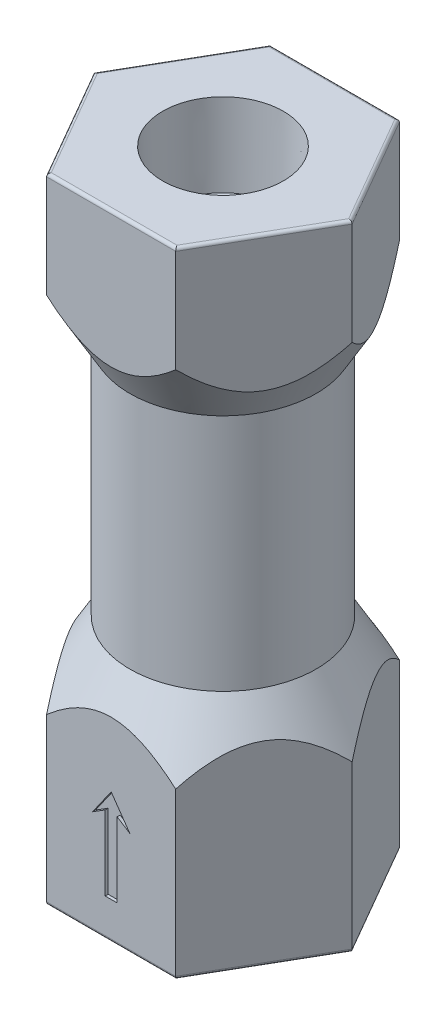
ISO-10303-21;
HEADER;
FILE_DESCRIPTION(('STEP AP214'),'2;1');
FILE_NAME('part.step','',(''),(''),'','','');
FILE_SCHEMA(('AUTOMOTIVE_DESIGN { 1 0 10303 214 1 1 1 1 }'));
ENDSEC;
DATA;
#1=APPLICATION_CONTEXT('core data for automotive mechanical design processes');
#2=APPLICATION_PROTOCOL_DEFINITION('international standard','automotive_design',2000,#1);
#3=PRODUCT_CONTEXT('',#1,'mechanical');
#4=PRODUCT('Part','Part','',(#3));
#5=PRODUCT_RELATED_PRODUCT_CATEGORY('part','',(#4));
#6=PRODUCT_DEFINITION_FORMATION('','',#4);
#7=PRODUCT_DEFINITION_CONTEXT('part definition',#1,'design');
#8=PRODUCT_DEFINITION('design','',#6,#7);
#9=PRODUCT_DEFINITION_SHAPE('','',#8);
#10=(LENGTH_UNIT() NAMED_UNIT(*) SI_UNIT(.MILLI.,.METRE.));
#11=(NAMED_UNIT(*) PLANE_ANGLE_UNIT() SI_UNIT($,.RADIAN.));
#12=(NAMED_UNIT(*) SI_UNIT($,.STERADIAN.) SOLID_ANGLE_UNIT());
#13=UNCERTAINTY_MEASURE_WITH_UNIT(LENGTH_MEASURE(1.E-05),#10,'distance_accuracy_value','');
#14=(GEOMETRIC_REPRESENTATION_CONTEXT(3) GLOBAL_UNCERTAINTY_ASSIGNED_CONTEXT((#13)) GLOBAL_UNIT_ASSIGNED_CONTEXT((#10,
#11,#12)) REPRESENTATION_CONTEXT('',''));
#15=CARTESIAN_POINT('',(0.,0.,0.));
#16=DIRECTION('',(0.,0.,1.));
#17=DIRECTION('',(1.,0.,0.));
#18=AXIS2_PLACEMENT_3D('',#15,#16,#17);
#19=CARTESIAN_POINT('',(-5.49926131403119,53.975,-9.525));
#20=DIRECTION('',(0.866025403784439,0.,0.5));
#21=DIRECTION('',(0.5,0.,-0.866025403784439));
#22=AXIS2_PLACEMENT_3D('',#19,#20,#21);
#23=PLANE('',#22);
#24=DIRECTION('',(0.,-1.,0.));
#25=VECTOR('',#24,1.);
#26=CARTESIAN_POINT('',(-10.9985226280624,53.975,0.));
#27=LINE('',#26,#25);
#28=CARTESIAN_POINT('',(-10.9985226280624,14.065653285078,0.));
#29=VERTEX_POINT('',#28);
#30=CARTESIAN_POINT('',(-10.9985226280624,0.253999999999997,0.));
#31=VERTEX_POINT('',#30);
#32=EDGE_CURVE('E436',#29,#31,#27,.T.);
#33=ORIENTED_EDGE('',*,*,#32,.F.);
#34=CARTESIAN_POINT('',(-10.9986380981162,14.0654532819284,0.000199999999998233));
#35=CARTESIAN_POINT('',(-10.9411227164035,14.1650629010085,-0.0994195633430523));
#36=CARTESIAN_POINT('',(-10.8830294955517,14.2633548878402,-0.20003997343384));
#37=CARTESIAN_POINT('',(-10.7655687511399,14.4569112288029,-0.40348795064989));
#38=CARTESIAN_POINT('',(-10.7062008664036,14.5521747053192,-0.506316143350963));
#39=CARTESIAN_POINT('',(-10.5857888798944,14.7397164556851,-0.714875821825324));
#40=CARTESIAN_POINT('',(-10.5247375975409,14.8319763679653,-0.820619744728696));
#41=CARTESIAN_POINT('',(-10.4011631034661,15.0124353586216,-1.03465704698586));
#42=CARTESIAN_POINT('',(-10.3386400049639,15.1006347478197,-1.14295023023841));
#43=CARTESIAN_POINT('',(-10.1454147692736,15.3627209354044,-1.47762615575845));
#44=CARTESIAN_POINT('',(-10.0121495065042,15.5291928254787,-1.70844836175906));
#45=CARTESIAN_POINT('',(-9.73841454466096,15.8355905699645,-2.18257122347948));
#46=CARTESIAN_POINT('',(-9.59796167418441,15.9755751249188,-2.42584273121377));
#47=CARTESIAN_POINT('',(-9.37534994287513,16.1647124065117,-2.81141756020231));
#48=CARTESIAN_POINT('',(-9.29579862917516,16.2261848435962,-2.9492044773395));
#49=CARTESIAN_POINT('',(-9.13461298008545,16.3372127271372,-3.22838621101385));
#50=CARTESIAN_POINT('',(-9.05297848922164,16.3867672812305,-3.36978129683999));
#51=CARTESIAN_POINT('',(-8.88860511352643,16.4720628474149,-3.6544843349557));
#52=CARTESIAN_POINT('',(-8.80588022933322,16.5079108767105,-3.79776803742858));
#53=CARTESIAN_POINT('',(-8.63917585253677,16.5650574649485,-4.08650848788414));
#54=CARTESIAN_POINT('',(-8.55519644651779,16.5863570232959,-4.23196508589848));
#55=CARTESIAN_POINT('',(-8.38583678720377,16.6136744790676,-4.52530462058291));
#56=CARTESIAN_POINT('',(-8.30045074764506,16.6195507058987,-4.67319757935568));
#57=CARTESIAN_POINT('',(-8.12977856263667,16.615358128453,-4.96881047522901));
#58=CARTESIAN_POINT('',(-8.04449241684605,16.6052893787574,-5.1165304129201));
#59=CARTESIAN_POINT('',(-7.87453789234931,16.5695962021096,-5.41090028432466));
#60=CARTESIAN_POINT('',(-7.78987149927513,16.5439343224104,-5.55754677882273));
#61=CARTESIAN_POINT('',(-7.62197406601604,16.4780565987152,-5.84835366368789));
#62=CARTESIAN_POINT('',(-7.53874322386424,16.4378387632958,-5.99251371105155));
#63=CARTESIAN_POINT('',(-7.35037032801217,16.3307309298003,-6.31878513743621));
#64=CARTESIAN_POINT('',(-7.24584682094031,16.2594917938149,-6.49982516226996));
#65=CARTESIAN_POINT('',(-7.04042187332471,16.0985643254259,-6.85563160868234));
#66=CARTESIAN_POINT('',(-6.93952205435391,16.0088678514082,-7.03039522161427));
#67=CARTESIAN_POINT('',(-6.74107072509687,15.8139181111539,-7.37412300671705));
#68=CARTESIAN_POINT('',(-6.64353473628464,15.7086022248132,-7.5430602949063));
#69=CARTESIAN_POINT('',(-6.45213187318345,15.4855764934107,-7.87457977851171));
#70=CARTESIAN_POINT('',(-6.35826439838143,15.3678686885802,-8.03716301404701));
#71=CARTESIAN_POINT('',(-6.13098907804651,15.0652778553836,-8.43081541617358));
#72=CARTESIAN_POINT('',(-5.99950397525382,14.8746208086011,-8.65855429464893));
#73=CARTESIAN_POINT('',(-5.80770493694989,14.5778244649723,-8.99075997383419));
#74=CARTESIAN_POINT('',(-5.74501603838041,14.4776864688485,-9.09934033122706));
#75=CARTESIAN_POINT('',(-5.62105511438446,14.2740094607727,-9.31404694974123));
#76=CARTESIAN_POINT('',(-5.55978279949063,14.1704711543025,-9.4201737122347));
#77=CARTESIAN_POINT('',(-5.49914584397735,14.0654532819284,-9.5252));
#78=B_SPLINE_CURVE_WITH_KNOTS('',3,(#34,#35,#36,#37,#38,#39,#40,#41,#42,#43,#44,#45,#46,#47,#48,
#49,#50,#51,#52,#53,#54,#55,#56,#57,#58,#59,#60,#61,#62,#63,#64,#65,#66,#67,#68,#69,#70,#71,#72,
#73,#74,#75,#76,#77),.UNSPECIFIED.,.F.,.F.,(4,2,2,2,2,2,2,2,2,2,2,2,2,2,2,2,2,2,2,2,2,4),(0.,
0.456500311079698,0.913131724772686,1.37216773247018,1.83116854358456,2.77279659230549,
3.7123127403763,4.22361949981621,4.73496453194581,5.24223135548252,5.74946332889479,
6.2613384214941,6.77321176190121,7.2863194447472,7.7994973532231,8.4609712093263,
9.12273747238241,9.78723238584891,10.4516180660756,11.4251171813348,11.9064551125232,
12.3876938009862),.UNSPECIFIED.);
#79=CARTESIAN_POINT('',(-5.49926131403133,14.0656532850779,-9.525));
#80=VERTEX_POINT('',#79);
#81=EDGE_CURVE('E343',#29,#80,#78,.T.);
#82=ORIENTED_EDGE('',*,*,#81,.T.);
#83=DIRECTION('',(0.,-1.,0.));
#84=VECTOR('',#83,1.);
#85=CARTESIAN_POINT('',(-5.49926131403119,53.975,-9.525));
#86=LINE('',#85,#84);
#87=CARTESIAN_POINT('',(-5.49926131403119,0.253999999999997,-9.525));
#88=VERTEX_POINT('',#87);
#89=EDGE_CURVE('E416',#80,#88,#86,.T.);
#90=ORIENTED_EDGE('',*,*,#89,.T.);
#91=DIRECTION('',(-0.5,0.,0.866025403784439));
#92=VECTOR('',#91,1.);
#93=CARTESIAN_POINT('',(-5.49926131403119,0.253999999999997,-9.525));
#94=LINE('',#93,#92);
#95=EDGE_CURVE('E488',#88,#31,#94,.T.);
#96=ORIENTED_EDGE('',*,*,#95,.T.);
#97=EDGE_LOOP('',(#33,#82,#90,#96));
#98=FACE_BOUND('',#97,.T.);
#99=ADVANCED_FACE('F32',(#98),#23,.F.);
#100=CARTESIAN_POINT('',(-10.9985226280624,53.975,0.));
#101=DIRECTION('',(0.866025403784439,0.,-0.5));
#102=DIRECTION('',(-0.5,0.,-0.866025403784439));
#103=AXIS2_PLACEMENT_3D('',#100,#101,#102);
#104=PLANE('',#103);
#105=DIRECTION('',(0.,-1.,0.));
#106=VECTOR('',#105,1.);
#107=CARTESIAN_POINT('',(-5.49926131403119,53.975,9.525));
#108=LINE('',#107,#106);
#109=CARTESIAN_POINT('',(-5.49926131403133,14.0656532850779,9.525));
#110=VERTEX_POINT('',#109);
#111=CARTESIAN_POINT('',(-5.49926131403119,0.253999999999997,9.525));
#112=VERTEX_POINT('',#111);
#113=EDGE_CURVE('E432',#110,#112,#108,.T.);
#114=ORIENTED_EDGE('',*,*,#113,.F.);
#115=CARTESIAN_POINT('',(-5.49914584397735,14.0654532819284,9.5252));
#116=CARTESIAN_POINT('',(-5.55666122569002,14.1650629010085,9.42558043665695));
#117=CARTESIAN_POINT('',(-5.6147544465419,14.2633548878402,9.32496002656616));
#118=CARTESIAN_POINT('',(-5.73221519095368,14.4569112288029,9.12151204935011));
#119=CARTESIAN_POINT('',(-5.79158307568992,14.5521747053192,9.01868385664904));
#120=CARTESIAN_POINT('',(-5.91199506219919,14.7397164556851,8.81012417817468));
#121=CARTESIAN_POINT('',(-5.97304634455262,14.8319763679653,8.70438025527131));
#122=CARTESIAN_POINT('',(-6.09662083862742,15.0124353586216,8.49034295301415));
#123=CARTESIAN_POINT('',(-6.15914393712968,15.1006347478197,8.38204976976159));
#124=CARTESIAN_POINT('',(-6.35236917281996,15.3627209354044,8.04737384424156));
#125=CARTESIAN_POINT('',(-6.48563443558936,15.5291928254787,7.81655163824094));
#126=CARTESIAN_POINT('',(-6.7593693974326,15.8355905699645,7.34242877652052));
#127=CARTESIAN_POINT('',(-6.89982226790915,15.9755751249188,7.09915726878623));
#128=CARTESIAN_POINT('',(-7.12243399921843,16.1647124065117,6.71358243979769));
#129=CARTESIAN_POINT('',(-7.2019853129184,16.2261848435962,6.5757955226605));
#130=CARTESIAN_POINT('',(-7.36317096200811,16.3372127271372,6.29661378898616));
#131=CARTESIAN_POINT('',(-7.44480545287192,16.3867672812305,6.15521870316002));
#132=CARTESIAN_POINT('',(-7.60917882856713,16.4720628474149,5.87051566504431));
#133=CARTESIAN_POINT('',(-7.69190371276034,16.5079108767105,5.72723196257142));
#134=CARTESIAN_POINT('',(-7.85860808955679,16.5650574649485,5.43849151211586));
#135=CARTESIAN_POINT('',(-7.94258749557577,16.5863570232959,5.29303491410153));
#136=CARTESIAN_POINT('',(-8.11194715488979,16.6136744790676,4.9996953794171));
#137=CARTESIAN_POINT('',(-8.1973331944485,16.6195507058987,4.85180242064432));
#138=CARTESIAN_POINT('',(-8.36800537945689,16.615358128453,4.55618952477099));
#139=CARTESIAN_POINT('',(-8.45329152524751,16.6052893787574,4.4084695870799));
#140=CARTESIAN_POINT('',(-8.62324604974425,16.5695962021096,4.11409971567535));
#141=CARTESIAN_POINT('',(-8.70791244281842,16.5439343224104,3.96745322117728));
#142=CARTESIAN_POINT('',(-8.87580987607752,16.4780565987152,3.67664633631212));
#143=CARTESIAN_POINT('',(-8.95904071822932,16.4378387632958,3.53248628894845));
#144=CARTESIAN_POINT('',(-9.14741361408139,16.3307309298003,3.20621486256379));
#145=CARTESIAN_POINT('',(-9.25193712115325,16.2594917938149,3.02517483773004));
#146=CARTESIAN_POINT('',(-9.45736206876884,16.0985643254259,2.66936839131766));
#147=CARTESIAN_POINT('',(-9.55826188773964,16.0088678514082,2.49460477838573));
#148=CARTESIAN_POINT('',(-9.75671321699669,15.8139181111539,2.15087699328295));
#149=CARTESIAN_POINT('',(-9.85424920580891,15.7086022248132,1.98193970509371));
#150=CARTESIAN_POINT('',(-10.0456520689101,15.4855764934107,1.6504202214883));
#151=CARTESIAN_POINT('',(-10.1395195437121,15.3678686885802,1.48783698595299));
#152=CARTESIAN_POINT('',(-10.366794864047,15.0652778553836,1.09418458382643));
#153=CARTESIAN_POINT('',(-10.4982799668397,14.8746208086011,0.86644570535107));
#154=CARTESIAN_POINT('',(-10.6900790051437,14.5778244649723,0.534240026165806));
#155=CARTESIAN_POINT('',(-10.7527679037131,14.4776864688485,0.425659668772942));
#156=CARTESIAN_POINT('',(-10.8767288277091,14.2740094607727,0.210953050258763));
#157=CARTESIAN_POINT('',(-10.9380011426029,14.1704711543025,0.104826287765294));
#158=CARTESIAN_POINT('',(-10.9986380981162,14.0654532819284,-0.000200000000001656));
#159=B_SPLINE_CURVE_WITH_KNOTS('',3,(#115,#116,#117,#118,#119,#120,#121,#122,#123,#124,#125,
#126,#127,#128,#129,#130,#131,#132,#133,#134,#135,#136,#137,#138,#139,#140,#141,#142,#143,#144,
#145,#146,#147,#148,#149,#150,#151,#152,#153,#154,#155,#156,#157,#158),.UNSPECIFIED.,.F.,.F.,(4,
2,2,2,2,2,2,2,2,2,2,2,2,2,2,2,2,2,2,2,2,4),(0.,0.456500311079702,0.913131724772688,
1.37216773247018,1.83116854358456,2.77279659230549,3.7123127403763,4.2236194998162,
4.73496453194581,5.24223135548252,5.74946332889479,6.2613384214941,6.77321176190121,
7.2863194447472,7.7994973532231,8.4609712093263,9.12273747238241,9.7872323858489,
10.4516180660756,11.4251171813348,11.9064551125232,12.3876938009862),.UNSPECIFIED.);
#160=EDGE_CURVE('E336',#110,#29,#159,.T.);
#161=ORIENTED_EDGE('',*,*,#160,.T.);
#162=ORIENTED_EDGE('',*,*,#32,.T.);
#163=DIRECTION('',(0.5,0.,0.866025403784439));
#164=VECTOR('',#163,1.);
#165=CARTESIAN_POINT('',(-10.9985226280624,0.253999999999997,0.));
#166=LINE('',#165,#164);
#167=EDGE_CURVE('E484',#31,#112,#166,.T.);
#168=ORIENTED_EDGE('',*,*,#167,.T.);
#169=EDGE_LOOP('',(#114,#161,#162,#168));
#170=FACE_BOUND('',#169,.T.);
#171=ADVANCED_FACE('F330',(#170),#104,.F.);
#172=CARTESIAN_POINT('',(-5.49926131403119,53.975,9.525));
#173=DIRECTION('',(0.,0.,-1.));
#174=DIRECTION('',(-1.,0.,0.));
#175=AXIS2_PLACEMENT_3D('',#172,#173,#174);
#176=PLANE('',#175);
#177=DIRECTION('',(0.,1.,0.));
#178=VECTOR('',#177,1.);
#179=CARTESIAN_POINT('',(0.508000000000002,3.175,9.525));
#180=LINE('',#179,#178);
#181=CARTESIAN_POINT('',(0.508000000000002,3.175,9.525));
#182=VERTEX_POINT('',#181);
#183=CARTESIAN_POINT('',(0.508000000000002,9.525,9.525));
#184=VERTEX_POINT('',#183);
#185=EDGE_CURVE('E242',#182,#184,#180,.T.);
#186=ORIENTED_EDGE('',*,*,#185,.F.);
#187=DIRECTION('',(1.,0.,0.));
#188=VECTOR('',#187,1.);
#189=CARTESIAN_POINT('',(-0.507999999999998,3.175,9.525));
#190=LINE('',#189,#188);
#191=CARTESIAN_POINT('',(-0.507999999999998,3.175,9.525));
#192=VERTEX_POINT('',#191);
#193=EDGE_CURVE('E52',#192,#182,#190,.T.);
#194=ORIENTED_EDGE('',*,*,#193,.F.);
#195=DIRECTION('',(0.,-1.,0.));
#196=VECTOR('',#195,1.);
#197=CARTESIAN_POINT('',(-0.507999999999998,3.175,9.525));
#198=LINE('',#197,#196);
#199=CARTESIAN_POINT('',(-0.507999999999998,9.525,9.525));
#200=VERTEX_POINT('',#199);
#201=EDGE_CURVE('E225',#200,#192,#198,.T.);
#202=ORIENTED_EDGE('',*,*,#201,.F.);
#203=DIRECTION('',(0.8462329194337,0.532813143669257,0.));
#204=VECTOR('',#203,1.);
#205=CARTESIAN_POINT('',(-0.507999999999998,9.525,9.525));
#206=LINE('',#205,#204);
#207=CARTESIAN_POINT('',(-1.5875,8.8453150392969,9.525));
#208=VERTEX_POINT('',#207);
#209=EDGE_CURVE('E228',#208,#200,#206,.T.);
#210=ORIENTED_EDGE('',*,*,#209,.F.);
#211=DIRECTION('',(-0.573576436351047,-0.819152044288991,0.));
#212=VECTOR('',#211,1.);
#213=CARTESIAN_POINT('',(-1.5875,8.8453150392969,9.525));
#214=LINE('',#213,#212);
#215=CARTESIAN_POINT('',(0.,11.1125,9.525));
#216=VERTEX_POINT('',#215);
#217=EDGE_CURVE('E250',#216,#208,#214,.T.);
#218=ORIENTED_EDGE('',*,*,#217,.F.);
#219=DIRECTION('',(-0.573576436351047,0.819152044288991,0.));
#220=VECTOR('',#219,1.);
#221=CARTESIAN_POINT('',(1.5875,8.8453150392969,9.525));
#222=LINE('',#221,#220);
#223=CARTESIAN_POINT('',(1.5875,8.8453150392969,9.525));
#224=VERTEX_POINT('',#223);
#225=EDGE_CURVE('E247',#224,#216,#222,.T.);
#226=ORIENTED_EDGE('',*,*,#225,.F.);
#227=DIRECTION('',(0.8462329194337,-0.532813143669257,0.));
#228=VECTOR('',#227,1.);
#229=CARTESIAN_POINT('',(0.508000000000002,9.525,9.525));
#230=LINE('',#229,#228);
#231=EDGE_CURVE('E244',#184,#224,#230,.T.);
#232=ORIENTED_EDGE('',*,*,#231,.F.);
#233=EDGE_LOOP('',(#186,#194,#202,#210,#218,#226,#232));
#234=FACE_BOUND('',#233,.T.);
#235=DIRECTION('',(0.,-1.,0.));
#236=VECTOR('',#235,1.);
#237=CARTESIAN_POINT('',(5.49926131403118,53.975,9.525));
#238=LINE('',#237,#236);
#239=CARTESIAN_POINT('',(5.49926131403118,14.065653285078,9.525));
#240=VERTEX_POINT('',#239);
#241=CARTESIAN_POINT('',(5.49926131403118,0.253999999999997,9.525));
#242=VERTEX_POINT('',#241);
#243=EDGE_CURVE('E429',#240,#242,#238,.T.);
#244=ORIENTED_EDGE('',*,*,#243,.F.);
#245=CARTESIAN_POINT('',(-12.6341589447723,5.7104933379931,9.525));
#246=CARTESIAN_POINT('',(-12.369332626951,6.0766844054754,9.525));
#247=CARTESIAN_POINT('',(-12.1025848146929,6.4415039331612,9.525));
#248=CARTESIAN_POINT('',(-11.5643597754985,7.16775119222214,9.525));
#249=CARTESIAN_POINT('',(-11.292881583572,7.52917820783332,9.525));
#250=CARTESIAN_POINT('',(-10.7419975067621,8.25101156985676,9.525));
#251=CARTESIAN_POINT('',(-10.4625427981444,8.61138074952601,9.525));
#252=CARTESIAN_POINT('',(-9.89691206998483,9.32676163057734,9.525));
#253=CARTESIAN_POINT('',(-9.61073670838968,9.68177385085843,9.525));
#254=CARTESIAN_POINT('',(-8.99881918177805,10.423047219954,9.525));
#255=CARTESIAN_POINT('',(-8.67214295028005,10.8085399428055,9.525));
#256=CARTESIAN_POINT('',(-8.00597584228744,11.5686170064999,9.525));
#257=CARTESIAN_POINT('',(-7.6664808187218,11.9431977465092,9.525));
#258=CARTESIAN_POINT('',(-7.1456744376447,12.4927849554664,9.525));
#259=CARTESIAN_POINT('',(-6.9704896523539,12.6736005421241,9.525));
#260=CARTESIAN_POINT('',(-6.61549465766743,13.0306236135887,9.525));
#261=CARTESIAN_POINT('',(-6.43568477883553,13.2068314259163,9.525));
#262=CARTESIAN_POINT('',(-6.0708871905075,13.5535931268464,9.525));
#263=CARTESIAN_POINT('',(-5.8859026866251,13.7241503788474,9.525));
#264=CARTESIAN_POINT('',(-5.50991443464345,14.058470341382,9.525));
#265=CARTESIAN_POINT('',(-5.31891173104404,14.222234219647,9.525));
#266=CARTESIAN_POINT('',(-5.00563913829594,14.4793084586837,9.525));
#267=CARTESIAN_POINT('',(-4.88552799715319,14.5752492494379,9.525));
#268=CARTESIAN_POINT('',(-4.64251948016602,14.7635300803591,9.525));
#269=CARTESIAN_POINT('',(-4.51962207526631,14.8558700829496,9.525));
#270=CARTESIAN_POINT('',(-4.14626010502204,15.1268309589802,9.525));
#271=CARTESIAN_POINT('',(-3.89123941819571,15.2992981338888,9.525));
#272=CARTESIAN_POINT('',(-3.37149326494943,15.6198388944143,9.525));
#273=CARTESIAN_POINT('',(-3.10697325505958,15.768242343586,9.525));
#274=CARTESIAN_POINT('',(-2.56388260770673,16.0365727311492,9.525));
#275=CARTESIAN_POINT('',(-2.28533030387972,16.1565357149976,9.525));
#276=CARTESIAN_POINT('',(-1.84374684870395,16.313729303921,9.525));
#277=CARTESIAN_POINT('',(-1.68527897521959,16.3638705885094,9.525));
#278=CARTESIAN_POINT('',(-1.36488577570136,16.4516011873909,9.525));
#279=CARTESIAN_POINT('',(-1.20296098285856,16.4891924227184,9.525));
#280=CARTESIAN_POINT('',(-0.876621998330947,16.5505264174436,9.525));
#281=CARTESIAN_POINT('',(-0.71220990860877,16.5742802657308,9.525));
#282=CARTESIAN_POINT('',(-0.381908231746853,16.6070825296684,9.525));
#283=CARTESIAN_POINT('',(-0.216018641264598,16.6161309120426,9.525));
#284=CARTESIAN_POINT('',(0.11634083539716,16.6191561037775,9.525));
#285=CARTESIAN_POINT('',(0.282811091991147,16.6130927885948,9.525));
#286=CARTESIAN_POINT('',(0.614522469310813,16.586060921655,9.525));
#287=CARTESIAN_POINT('',(0.779763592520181,16.5650924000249,9.525));
#288=CARTESIAN_POINT('',(1.10797647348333,16.5090401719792,9.525));
#289=CARTESIAN_POINT('',(1.27094588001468,16.4739428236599,9.525));
#290=CARTESIAN_POINT('',(1.59355040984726,16.3908608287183,9.525));
#291=CARTESIAN_POINT('',(1.75318502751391,16.3428742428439,9.525));
#292=CARTESIAN_POINT('',(2.13782249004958,16.2118306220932,9.525));
#293=CARTESIAN_POINT('',(2.36073504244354,16.1226277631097,9.525));
#294=CARTESIAN_POINT('',(2.79775530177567,15.9248000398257,9.525));
#295=CARTESIAN_POINT('',(3.01185788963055,15.8161640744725,9.525));
#296=CARTESIAN_POINT('',(3.43343494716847,15.5822142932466,9.525));
#297=CARTESIAN_POINT('',(3.64082324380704,15.4567465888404,9.525));
#298=CARTESIAN_POINT('',(4.04728144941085,15.1932676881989,9.525));
#299=CARTESIAN_POINT('',(4.24635436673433,15.055261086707,9.525));
#300=CARTESIAN_POINT('',(4.75319513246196,14.684272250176,9.525));
#301=CARTESIAN_POINT('',(5.05529445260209,14.443564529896,9.525));
#302=CARTESIAN_POINT('',(5.64422853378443,13.9440255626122,9.525));
#303=CARTESIAN_POINT('',(5.93105232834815,13.6851815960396,9.525));
#304=CARTESIAN_POINT('',(6.49321903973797,13.1532949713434,9.525));
#305=CARTESIAN_POINT('',(6.76851391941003,12.8802018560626,9.525));
#306=CARTESIAN_POINT('',(7.30871368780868,12.3241317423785,9.525));
#307=CARTESIAN_POINT('',(7.57362136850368,12.041157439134,9.525));
#308=CARTESIAN_POINT('',(8.07749980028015,11.4867567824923,9.525));
#309=CARTESIAN_POINT('',(8.317019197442,11.2158268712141,9.525));
#310=CARTESIAN_POINT('',(8.78988253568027,10.6685997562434,9.525));
#311=CARTESIAN_POINT('',(9.02322589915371,10.3923020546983,9.525));
#312=CARTESIAN_POINT('',(9.48260869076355,9.83786064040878,9.525));
#313=CARTESIAN_POINT('',(9.70869472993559,9.55975543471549,9.525));
#314=CARTESIAN_POINT('',(10.1563782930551,9.00006198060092,9.525));
#315=CARTESIAN_POINT('',(10.3779768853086,8.718474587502,9.525));
#316=CARTESIAN_POINT('',(10.5977170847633,8.4354649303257,9.525));
#317=B_SPLINE_CURVE_WITH_KNOTS('',3,(#245,#246,#247,#248,#249,#250,#251,#252,#253,#254,#255,
#256,#257,#258,#259,#260,#261,#262,#263,#264,#265,#266,#267,#268,#269,#270,#271,#272,#273,#274,
#275,#276,#277,#278,#279,#280,#281,#282,#283,#284,#285,#286,#287,#288,#289,#290,#291,#292,#293,
#294,#295,#296,#297,#298,#299,#300,#301,#302,#303,#304,#305,#306,#307,#308,#309,#310,#311,#312,
#313,#314,#315,#316),.UNSPECIFIED.,.F.,.F.,(4,2,2,2,2,2,2,2,2,2,2,2,2,2,2,2,2,2,2,2,2,2,2,2,2,2,
2,2,2,2,2,2,2,2,2,4),(0.,1.35576632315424,2.71181253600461,4.07982790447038,5.44770989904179,
6.96339681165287,8.47957834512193,9.2347972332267,9.98996229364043,10.7446694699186,
11.4992463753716,11.9603581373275,12.4214747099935,13.3441506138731,14.2528534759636,
15.1603984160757,15.6586038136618,16.1567329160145,16.6544622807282,17.1521927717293,
17.6512462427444,18.150298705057,18.6498341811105,19.1494448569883,19.8685314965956,
20.5880302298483,21.3146235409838,22.040951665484,23.1986801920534,24.3572289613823,
25.5202029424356,26.6828621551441,27.767628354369,28.8524956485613,29.9276768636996,
31.0025990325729),.UNSPECIFIED.);
#318=EDGE_CURVE('E344',#240,#110,#317,.F.);
#319=ORIENTED_EDGE('',*,*,#318,.T.);
#320=ORIENTED_EDGE('',*,*,#113,.T.);
#321=DIRECTION('',(1.,0.,0.));
#322=VECTOR('',#321,1.);
#323=CARTESIAN_POINT('',(-5.49926131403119,0.253999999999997,9.525));
#324=LINE('',#323,#322);
#325=EDGE_CURVE('E451',#112,#242,#324,.T.);
#326=ORIENTED_EDGE('',*,*,#325,.T.);
#327=EDGE_LOOP('',(#244,#319,#320,#326));
#328=FACE_BOUND('',#327,.T.);
#329=ADVANCED_FACE('F388',(#234,#328),#176,.F.);
#330=CARTESIAN_POINT('',(5.49926131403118,53.975,9.525));
#331=DIRECTION('',(-0.866025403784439,0.,-0.5));
#332=DIRECTION('',(-0.5,0.,0.866025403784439));
#333=AXIS2_PLACEMENT_3D('',#330,#331,#332);
#334=PLANE('',#333);
#335=DIRECTION('',(0.,-1.,0.));
#336=VECTOR('',#335,1.);
#337=CARTESIAN_POINT('',(10.9985226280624,53.975,0.));
#338=LINE('',#337,#336);
#339=CARTESIAN_POINT('',(10.9985226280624,14.065653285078,0.));
#340=VERTEX_POINT('',#339);
#341=CARTESIAN_POINT('',(10.9985226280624,0.253999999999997,0.));
#342=VERTEX_POINT('',#341);
#343=EDGE_CURVE('E425',#340,#342,#338,.T.);
#344=ORIENTED_EDGE('',*,*,#343,.F.);
#345=CARTESIAN_POINT('',(10.9986380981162,14.0654532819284,-0.000199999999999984));
#346=CARTESIAN_POINT('',(10.9411227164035,14.1650629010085,0.0994195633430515));
#347=CARTESIAN_POINT('',(10.8830294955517,14.2633548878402,0.200039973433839));
#348=CARTESIAN_POINT('',(10.7655687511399,14.4569112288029,0.40348795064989));
#349=CARTESIAN_POINT('',(10.7062008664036,14.5521747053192,0.506316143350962));
#350=CARTESIAN_POINT('',(10.5857888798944,14.7397164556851,0.714875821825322));
#351=CARTESIAN_POINT('',(10.5247375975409,14.8319763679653,0.820619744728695));
#352=CARTESIAN_POINT('',(10.4011631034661,15.0124353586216,1.03465704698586));
#353=CARTESIAN_POINT('',(10.3386400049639,15.1006347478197,1.14295023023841));
#354=CARTESIAN_POINT('',(10.1454147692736,15.3627209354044,1.47762615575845));
#355=CARTESIAN_POINT('',(10.0121495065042,15.5291928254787,1.70844836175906));
#356=CARTESIAN_POINT('',(9.73841454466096,15.8355905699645,2.18257122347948));
#357=CARTESIAN_POINT('',(9.5979616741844,15.9755751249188,2.42584273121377));
#358=CARTESIAN_POINT('',(9.37534994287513,16.1647124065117,2.81141756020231));
#359=CARTESIAN_POINT('',(9.29579862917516,16.2261848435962,2.9492044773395));
#360=CARTESIAN_POINT('',(9.13461298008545,16.3372127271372,3.22838621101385));
#361=CARTESIAN_POINT('',(9.05297848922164,16.3867672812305,3.36978129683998));
#362=CARTESIAN_POINT('',(8.88860511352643,16.4720628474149,3.65448433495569));
#363=CARTESIAN_POINT('',(8.80588022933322,16.5079108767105,3.79776803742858));
#364=CARTESIAN_POINT('',(8.63917585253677,16.5650574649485,4.08650848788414));
#365=CARTESIAN_POINT('',(8.55519644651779,16.5863570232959,4.23196508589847));
#366=CARTESIAN_POINT('',(8.38583678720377,16.6136744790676,4.5253046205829));
#367=CARTESIAN_POINT('',(8.30045074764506,16.6195507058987,4.67319757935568));
#368=CARTESIAN_POINT('',(8.12977856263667,16.6153581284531,4.968810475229));
#369=CARTESIAN_POINT('',(8.04449241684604,16.6052893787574,5.1165304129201));
#370=CARTESIAN_POINT('',(7.87453789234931,16.5695962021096,5.41090028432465));
#371=CARTESIAN_POINT('',(7.78987149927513,16.5439343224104,5.55754677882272));
#372=CARTESIAN_POINT('',(7.62197406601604,16.4780565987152,5.84835366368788));
#373=CARTESIAN_POINT('',(7.53874322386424,16.4378387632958,5.99251371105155));
#374=CARTESIAN_POINT('',(7.35037032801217,16.3307309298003,6.31878513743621));
#375=CARTESIAN_POINT('',(7.24584682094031,16.2594917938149,6.49982516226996));
#376=CARTESIAN_POINT('',(7.04042187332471,16.0985643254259,6.85563160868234));
#377=CARTESIAN_POINT('',(6.93952205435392,16.0088678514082,7.03039522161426));
#378=CARTESIAN_POINT('',(6.74107072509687,15.8139181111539,7.37412300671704));
#379=CARTESIAN_POINT('',(6.64353473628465,15.7086022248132,7.54306029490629));
#380=CARTESIAN_POINT('',(6.45213187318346,15.4855764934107,7.8745797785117));
#381=CARTESIAN_POINT('',(6.35826439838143,15.3678686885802,8.037163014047));
#382=CARTESIAN_POINT('',(6.13098907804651,15.0652778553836,8.43081541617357));
#383=CARTESIAN_POINT('',(5.99950397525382,14.8746208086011,8.65855429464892));
#384=CARTESIAN_POINT('',(5.80770493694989,14.5778244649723,8.99075997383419));
#385=CARTESIAN_POINT('',(5.74501603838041,14.4776864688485,9.09934033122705));
#386=CARTESIAN_POINT('',(5.62105511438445,14.2740094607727,9.31404694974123));
#387=CARTESIAN_POINT('',(5.55978279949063,14.1704711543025,9.42017371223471));
#388=CARTESIAN_POINT('',(5.49914584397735,14.0654532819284,9.5252));
#389=B_SPLINE_CURVE_WITH_KNOTS('',3,(#345,#346,#347,#348,#349,#350,#351,#352,#353,#354,#355,
#356,#357,#358,#359,#360,#361,#362,#363,#364,#365,#366,#367,#368,#369,#370,#371,#372,#373,#374,
#375,#376,#377,#378,#379,#380,#381,#382,#383,#384,#385,#386,#387,#388),.UNSPECIFIED.,.F.,.F.,(4,
2,2,2,2,2,2,2,2,2,2,2,2,2,2,2,2,2,2,2,2,4),(0.,0.456500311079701,0.913131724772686,
1.37216773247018,1.83116854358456,2.77279659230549,3.7123127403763,4.2236194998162,
4.73496453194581,5.24223135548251,5.74946332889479,6.26133842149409,6.77321176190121,
7.2863194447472,7.7994973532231,8.4609712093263,9.1227374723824,9.7872323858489,
10.4516180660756,11.4251171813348,11.9064551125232,12.3876938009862),.UNSPECIFIED.);
#390=EDGE_CURVE('E369',#340,#240,#389,.T.);
#391=ORIENTED_EDGE('',*,*,#390,.T.);
#392=ORIENTED_EDGE('',*,*,#243,.T.);
#393=DIRECTION('',(0.5,0.,-0.866025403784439));
#394=VECTOR('',#393,1.);
#395=CARTESIAN_POINT('',(5.49926131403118,0.253999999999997,9.525));
#396=LINE('',#395,#394);
#397=EDGE_CURVE('E469',#242,#342,#396,.T.);
#398=ORIENTED_EDGE('',*,*,#397,.T.);
#399=EDGE_LOOP('',(#344,#391,#392,#398));
#400=FACE_BOUND('',#399,.T.);
#401=ADVANCED_FACE('F378',(#400),#334,.F.);
#402=CARTESIAN_POINT('',(10.9985226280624,53.975,0.));
#403=DIRECTION('',(-0.866025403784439,0.,0.5));
#404=DIRECTION('',(0.5,0.,0.866025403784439));
#405=AXIS2_PLACEMENT_3D('',#402,#403,#404);
#406=PLANE('',#405);
#407=DIRECTION('',(0.,-1.,0.));
#408=VECTOR('',#407,1.);
#409=CARTESIAN_POINT('',(5.49926131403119,53.975,-9.525));
#410=LINE('',#409,#408);
#411=CARTESIAN_POINT('',(5.49926131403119,14.065653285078,-9.525));
#412=VERTEX_POINT('',#411);
#413=CARTESIAN_POINT('',(5.49926131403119,0.253999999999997,-9.525));
#414=VERTEX_POINT('',#413);
#415=EDGE_CURVE('E415',#412,#414,#410,.T.);
#416=ORIENTED_EDGE('',*,*,#415,.F.);
#417=CARTESIAN_POINT('',(5.49914584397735,14.0654532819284,-9.5252));
#418=CARTESIAN_POINT('',(5.55666122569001,14.1650629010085,-9.42558043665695));
#419=CARTESIAN_POINT('',(5.6147544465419,14.2633548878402,-9.32496002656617));
#420=CARTESIAN_POINT('',(5.73221519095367,14.4569112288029,-9.12151204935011));
#421=CARTESIAN_POINT('',(5.79158307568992,14.5521747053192,-9.01868385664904));
#422=CARTESIAN_POINT('',(5.91199506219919,14.7397164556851,-8.81012417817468));
#423=CARTESIAN_POINT('',(5.97304634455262,14.8319763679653,-8.70438025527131));
#424=CARTESIAN_POINT('',(6.09662083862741,15.0124353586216,-8.49034295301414));
#425=CARTESIAN_POINT('',(6.15914393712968,15.1006347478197,-8.38204976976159));
#426=CARTESIAN_POINT('',(6.35236917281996,15.3627209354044,-8.04737384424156));
#427=CARTESIAN_POINT('',(6.48563443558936,15.5291928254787,-7.81655163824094));
#428=CARTESIAN_POINT('',(6.75936939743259,15.8355905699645,-7.34242877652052));
#429=CARTESIAN_POINT('',(6.89982226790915,15.9755751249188,-7.09915726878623));
#430=CARTESIAN_POINT('',(7.12243399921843,16.1647124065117,-6.71358243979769));
#431=CARTESIAN_POINT('',(7.2019853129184,16.2261848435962,-6.5757955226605));
#432=CARTESIAN_POINT('',(7.3631709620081,16.3372127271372,-6.29661378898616));
#433=CARTESIAN_POINT('',(7.44480545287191,16.3867672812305,-6.15521870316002));
#434=CARTESIAN_POINT('',(7.60917882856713,16.4720628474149,-5.87051566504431));
#435=CARTESIAN_POINT('',(7.69190371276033,16.5079108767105,-5.72723196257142));
#436=CARTESIAN_POINT('',(7.85860808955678,16.5650574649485,-5.43849151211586));
#437=CARTESIAN_POINT('',(7.94258749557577,16.5863570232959,-5.29303491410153));
#438=CARTESIAN_POINT('',(8.11194715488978,16.6136744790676,-4.9996953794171));
#439=CARTESIAN_POINT('',(8.19733319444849,16.6195507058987,-4.85180242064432));
#440=CARTESIAN_POINT('',(8.36800537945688,16.615358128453,-4.556189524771));
#441=CARTESIAN_POINT('',(8.45329152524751,16.6052893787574,-4.40846958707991));
#442=CARTESIAN_POINT('',(8.62324604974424,16.5695962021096,-4.11409971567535));
#443=CARTESIAN_POINT('',(8.70791244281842,16.5439343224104,-3.96745322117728));
#444=CARTESIAN_POINT('',(8.87580987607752,16.4780565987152,-3.67664633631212));
#445=CARTESIAN_POINT('',(8.95904071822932,16.4378387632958,-3.53248628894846));
#446=CARTESIAN_POINT('',(9.14741361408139,16.3307309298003,-3.20621486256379));
#447=CARTESIAN_POINT('',(9.25193712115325,16.2594917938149,-3.02517483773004));
#448=CARTESIAN_POINT('',(9.45736206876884,16.0985643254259,-2.66936839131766));
#449=CARTESIAN_POINT('',(9.55826188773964,16.0088678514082,-2.49460477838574));
#450=CARTESIAN_POINT('',(9.75671321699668,15.8139181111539,-2.15087699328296));
#451=CARTESIAN_POINT('',(9.85424920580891,15.7086022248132,-1.98193970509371));
#452=CARTESIAN_POINT('',(10.0456520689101,15.4855764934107,-1.6504202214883));
#453=CARTESIAN_POINT('',(10.1395195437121,15.3678686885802,-1.487836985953));
#454=CARTESIAN_POINT('',(10.366794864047,15.0652778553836,-1.09418458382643));
#455=CARTESIAN_POINT('',(10.4982799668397,14.8746208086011,-0.866445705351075));
#456=CARTESIAN_POINT('',(10.6900790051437,14.5778244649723,-0.53424002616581));
#457=CARTESIAN_POINT('',(10.7527679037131,14.4776864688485,-0.425659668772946));
#458=CARTESIAN_POINT('',(10.8767288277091,14.2740094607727,-0.210953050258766));
#459=CARTESIAN_POINT('',(10.9380011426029,14.1704711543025,-0.104826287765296));
#460=CARTESIAN_POINT('',(10.9986380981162,14.0654532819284,0.00020000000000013));
#461=B_SPLINE_CURVE_WITH_KNOTS('',3,(#417,#418,#419,#420,#421,#422,#423,#424,#425,#426,#427,
#428,#429,#430,#431,#432,#433,#434,#435,#436,#437,#438,#439,#440,#441,#442,#443,#444,#445,#446,
#447,#448,#449,#450,#451,#452,#453,#454,#455,#456,#457,#458,#459,#460),.UNSPECIFIED.,.F.,.F.,(4,
2,2,2,2,2,2,2,2,2,2,2,2,2,2,2,2,2,2,2,2,4),(0.,0.456500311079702,0.913131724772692,
1.37216773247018,1.83116854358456,2.77279659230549,3.7123127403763,4.22361949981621,
4.73496453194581,5.24223135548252,5.74946332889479,6.2613384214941,6.77321176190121,
7.2863194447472,7.7994973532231,8.4609712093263,9.12273747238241,9.7872323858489,
10.4516180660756,11.4251171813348,11.9064551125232,12.3876938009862),.UNSPECIFIED.);
#462=EDGE_CURVE('E364',#412,#340,#461,.T.);
#463=ORIENTED_EDGE('',*,*,#462,.T.);
#464=ORIENTED_EDGE('',*,*,#343,.T.);
#465=DIRECTION('',(-0.5,0.,-0.866025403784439));
#466=VECTOR('',#465,1.);
#467=CARTESIAN_POINT('',(10.9985226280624,0.253999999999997,0.));
#468=LINE('',#467,#466);
#469=EDGE_CURVE('E474',#342,#414,#468,.T.);
#470=ORIENTED_EDGE('',*,*,#469,.T.);
#471=EDGE_LOOP('',(#416,#463,#464,#470));
#472=FACE_BOUND('',#471,.T.);
#473=ADVANCED_FACE('F386',(#472),#406,.F.);
#474=CARTESIAN_POINT('',(5.49926131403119,53.975,-9.525));
#475=DIRECTION('',(0.,0.,1.));
#476=DIRECTION('',(1.,0.,0.));
#477=AXIS2_PLACEMENT_3D('',#474,#475,#476);
#478=PLANE('',#477);
#479=ORIENTED_EDGE('',*,*,#89,.F.);
#480=CARTESIAN_POINT('',(-12.6341585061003,5.71049394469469,-9.525));
#481=CARTESIAN_POINT('',(-12.3693322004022,6.0766849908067,-9.525));
#482=CARTESIAN_POINT('',(-12.1025844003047,6.44150449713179,-9.525));
#483=CARTESIAN_POINT('',(-11.5643593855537,7.16775171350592,-9.525));
#484=CARTESIAN_POINT('',(-11.2928812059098,7.52917870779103,-9.525));
#485=CARTESIAN_POINT('',(-10.7419971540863,8.25101202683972,-9.525));
#486=CARTESIAN_POINT('',(-10.4625424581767,8.61138118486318,-9.525));
#487=CARTESIAN_POINT('',(-9.89691175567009,9.32676202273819,-9.525));
#488=CARTESIAN_POINT('',(-9.61073640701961,9.68177422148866,-9.525));
#489=CARTESIAN_POINT('',(-8.99881891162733,10.4230475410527,-9.525));
#490=CARTESIAN_POINT('',(-8.67214269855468,10.8085402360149,-9.525));
#491=CARTESIAN_POINT('',(-8.00597562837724,11.5686172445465,-9.525));
#492=CARTESIAN_POINT('',(-7.66648062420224,11.9431979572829,-9.525));
#493=CARTESIAN_POINT('',(-7.14567427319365,12.492785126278,-9.525));
#494=CARTESIAN_POINT('',(-6.97048949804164,12.6736006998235,-9.525));
#495=CARTESIAN_POINT('',(-6.61549452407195,13.0306237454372,-9.525));
#496=CARTESIAN_POINT('',(-6.435684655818,13.2068315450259,-9.525));
#497=CARTESIAN_POINT('',(-6.07088708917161,13.5535932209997,-9.525));
#498=CARTESIAN_POINT('',(-5.88590259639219,13.7241504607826,-9.525));
#499=CARTESIAN_POINT('',(-5.5099143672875,14.0584703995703,-9.525));
#500=CARTESIAN_POINT('',(-5.31891167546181,14.2222342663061,-9.525));
#501=CARTESIAN_POINT('',(-5.00563909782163,14.4793084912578,-9.525));
#502=CARTESIAN_POINT('',(-4.88552795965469,14.5752492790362,-9.525));
#503=CARTESIAN_POINT('',(-4.64251944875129,14.7635301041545,-9.525));
#504=CARTESIAN_POINT('',(-4.51962204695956,14.8558701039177,-9.525));
#505=CARTESIAN_POINT('',(-4.14626008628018,15.126830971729,-9.525));
#506=CARTESIAN_POINT('',(-3.89123940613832,15.2992981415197,-9.525));
#507=CARTESIAN_POINT('',(-3.37149326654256,15.61983889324,-9.525));
#508=CARTESIAN_POINT('',(-3.10697326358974,15.7682423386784,-9.525));
#509=CARTESIAN_POINT('',(-2.56388263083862,16.0365727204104,-9.525));
#510=CARTESIAN_POINT('',(-2.28533033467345,16.1565357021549,-9.525));
#511=CARTESIAN_POINT('',(-1.84374688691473,16.3137292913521,-9.525));
#512=CARTESIAN_POINT('',(-1.68527901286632,16.3638705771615,-9.525));
#513=CARTESIAN_POINT('',(-1.36488581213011,16.4516011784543,-9.525));
#514=CARTESIAN_POINT('',(-1.20296101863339,16.489192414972,-9.525));
#515=CARTESIAN_POINT('',(-0.876622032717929,16.5505264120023,-9.525));
#516=CARTESIAN_POINT('',(-0.712209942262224,16.5742802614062,-9.525));
#517=CARTESIAN_POINT('',(-0.381908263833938,16.6070825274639,-9.525));
#518=CARTESIAN_POINT('',(-0.216018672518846,16.6161309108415,-9.525));
#519=CARTESIAN_POINT('',(0.116340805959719,16.6191561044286,-9.525));
#520=CARTESIAN_POINT('',(0.282811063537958,16.6130927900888,-9.525));
#521=CARTESIAN_POINT('',(0.614522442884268,16.5860609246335,-9.525));
#522=CARTESIAN_POINT('',(0.779763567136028,16.565092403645,-9.525));
#523=CARTESIAN_POINT('',(1.10797645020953,16.5090401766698,-9.525));
#524=CARTESIAN_POINT('',(1.27094585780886,16.4739428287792,-9.525));
#525=CARTESIAN_POINT('',(1.59355038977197,16.3908608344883,-9.525));
#526=CARTESIAN_POINT('',(1.75318500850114,16.3428742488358,-9.525));
#527=CARTESIAN_POINT('',(2.13782247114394,16.211830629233,-9.525));
#528=CARTESIAN_POINT('',(2.36073502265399,16.1226277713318,-9.525));
#529=CARTESIAN_POINT('',(2.79775528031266,15.9248000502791,-9.525));
#530=CARTESIAN_POINT('',(3.01185786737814,15.8161640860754,-9.525));
#531=CARTESIAN_POINT('',(3.43343492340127,15.5822143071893,-9.525));
#532=CARTESIAN_POINT('',(3.64082321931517,15.4567466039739,-9.525));
#533=CARTESIAN_POINT('',(4.04728142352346,15.1932677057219,-9.525));
#534=CARTESIAN_POINT('',(4.24635434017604,15.0552611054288,-9.525));
#535=CARTESIAN_POINT('',(4.7531951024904,14.6842722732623,-9.525));
#536=CARTESIAN_POINT('',(5.05529442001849,14.443564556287,-9.525));
#537=CARTESIAN_POINT('',(5.6442284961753,13.9440255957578,-9.525));
#538=CARTESIAN_POINT('',(5.93105228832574,13.6851816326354,-9.525));
#539=CARTESIAN_POINT('',(6.49321899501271,13.1532950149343,-9.525));
#540=CARTESIAN_POINT('',(6.76851387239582,12.8802019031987,-9.525));
#541=CARTESIAN_POINT('',(7.3087136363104,12.3241317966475,-9.525));
#542=CARTESIAN_POINT('',(7.57362131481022,12.0411574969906,-9.525));
#543=CARTESIAN_POINT('',(8.07749974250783,11.4867568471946,-9.525));
#544=CARTESIAN_POINT('',(8.31701913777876,11.21582693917,-9.525));
#545=CARTESIAN_POINT('',(8.78988247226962,10.6685998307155,-9.525));
#546=CARTESIAN_POINT('',(9.02322583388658,10.392302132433,-9.525));
#547=CARTESIAN_POINT('',(9.48260862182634,9.83786072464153,-9.525));
#548=CARTESIAN_POINT('',(9.70869465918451,9.55975552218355,-9.525));
#549=CARTESIAN_POINT('',(10.1563782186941,9.00006207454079,-9.525));
#550=CARTESIAN_POINT('',(10.3779768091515,8.71847468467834,-9.525));
#551=CARTESIAN_POINT('',(10.5977170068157,8.43546503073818,-9.525));
#552=B_SPLINE_CURVE_WITH_KNOTS('',3,(#480,#481,#482,#483,#484,#485,#486,#487,#488,#489,#490,
#491,#492,#493,#494,#495,#496,#497,#498,#499,#500,#501,#502,#503,#504,#505,#506,#507,#508,#509,
#510,#511,#512,#513,#514,#515,#516,#517,#518,#519,#520,#521,#522,#523,#524,#525,#526,#527,#528,
#529,#530,#531,#532,#533,#534,#535,#536,#537,#538,#539,#540,#541,#542,#543,#544,#545,#546,#547,
#548,#549,#550,#551),.UNSPECIFIED.,.F.,.F.,(4,2,2,2,2,2,2,2,2,2,2,2,2,2,2,2,2,2,2,2,2,2,2,2,2,2,
2,2,2,2,2,2,2,2,2,4),(0.,1.35576624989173,2.71181238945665,4.07982768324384,5.44770960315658,
6.9633964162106,8.47957785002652,9.23479668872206,9.98996169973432,10.7446688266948,
11.4992456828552,11.9603574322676,12.4214739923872,13.3441498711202,14.2528527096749,
15.1603976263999,15.6586030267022,16.1567321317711,16.6544614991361,17.1521919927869,
17.6512454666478,18.1502979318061,18.6498334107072,19.1494440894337,19.868530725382,
20.588029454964,21.3146227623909,22.0409508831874,23.1986793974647,24.3572281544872,
25.5202021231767,26.6828613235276,27.7676275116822,28.8524947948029,29.9276759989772,
31.0025981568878),.UNSPECIFIED.);
#553=EDGE_CURVE('E11',#80,#412,#552,.T.);
#554=ORIENTED_EDGE('',*,*,#553,.T.);
#555=ORIENTED_EDGE('',*,*,#415,.T.);
#556=DIRECTION('',(-1.,0.,0.));
#557=VECTOR('',#556,1.);
#558=CARTESIAN_POINT('',(5.49926131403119,0.253999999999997,-9.525));
#559=LINE('',#558,#557);
#560=EDGE_CURVE('E479',#414,#88,#559,.T.);
#561=ORIENTED_EDGE('',*,*,#560,.T.);
#562=EDGE_LOOP('',(#479,#554,#555,#561));
#563=FACE_BOUND('',#562,.T.);
#564=ADVANCED_FACE('F400',(#563),#478,.F.);
#565=CARTESIAN_POINT('',(-5.49926131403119,53.721,-9.525));
#566=VERTEX_POINT('',#565);
#567=CARTESIAN_POINT('',(-5.49926131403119,44.989346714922,-9.525));
#568=VERTEX_POINT('',#567);
#569=EDGE_CURVE('E409',#566,#568,#86,.T.);
#570=ORIENTED_EDGE('',*,*,#569,.T.);
#571=CARTESIAN_POINT('',(-5.49914584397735,44.9895467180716,-9.5252));
#572=CARTESIAN_POINT('',(-5.55666122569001,44.8899370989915,-9.42558043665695));
#573=CARTESIAN_POINT('',(-5.6147544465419,44.7916451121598,-9.32496002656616));
#574=CARTESIAN_POINT('',(-5.73221519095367,44.5980887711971,-9.12151204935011));
#575=CARTESIAN_POINT('',(-5.79158307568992,44.5028252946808,-9.01868385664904));
#576=CARTESIAN_POINT('',(-5.91199506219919,44.3152835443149,-8.81012417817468));
#577=CARTESIAN_POINT('',(-5.97304634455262,44.2230236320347,-8.70438025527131));
#578=CARTESIAN_POINT('',(-6.09662083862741,44.0425646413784,-8.49034295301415));
#579=CARTESIAN_POINT('',(-6.15914393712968,43.9543652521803,-8.38204976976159));
#580=CARTESIAN_POINT('',(-6.35236917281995,43.6922790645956,-8.04737384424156));
#581=CARTESIAN_POINT('',(-6.48563443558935,43.5258071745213,-7.81655163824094));
#582=CARTESIAN_POINT('',(-6.7593693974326,43.2194094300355,-7.34242877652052));
#583=CARTESIAN_POINT('',(-6.89982226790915,43.0794248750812,-7.09915726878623));
#584=CARTESIAN_POINT('',(-7.12243399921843,42.8902875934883,-6.7135824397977));
#585=CARTESIAN_POINT('',(-7.20198531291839,42.8288151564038,-6.5757955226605));
#586=CARTESIAN_POINT('',(-7.3631709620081,42.7177872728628,-6.29661378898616));
#587=CARTESIAN_POINT('',(-7.44480545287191,42.6682327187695,-6.15521870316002));
#588=CARTESIAN_POINT('',(-7.60917882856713,42.5829371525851,-5.87051566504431));
#589=CARTESIAN_POINT('',(-7.69190371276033,42.5470891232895,-5.72723196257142));
#590=CARTESIAN_POINT('',(-7.85860808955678,42.4899425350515,-5.43849151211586));
#591=CARTESIAN_POINT('',(-7.94258749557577,42.4686429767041,-5.29303491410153));
#592=CARTESIAN_POINT('',(-8.11194715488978,42.4413255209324,-4.9996953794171));
#593=CARTESIAN_POINT('',(-8.19733319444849,42.4354492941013,-4.85180242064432));
#594=CARTESIAN_POINT('',(-8.36800537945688,42.4396418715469,-4.556189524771));
#595=CARTESIAN_POINT('',(-8.45329152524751,42.4497106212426,-4.40846958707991));
#596=CARTESIAN_POINT('',(-8.62324604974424,42.4854037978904,-4.11409971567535));
#597=CARTESIAN_POINT('',(-8.70791244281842,42.5110656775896,-3.96745322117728));
#598=CARTESIAN_POINT('',(-8.87580987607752,42.5769434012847,-3.67664633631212));
#599=CARTESIAN_POINT('',(-8.95904071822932,42.6171612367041,-3.53248628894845));
#600=CARTESIAN_POINT('',(-9.14741361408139,42.7242690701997,-3.20621486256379));
#601=CARTESIAN_POINT('',(-9.25193712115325,42.7955082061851,-3.02517483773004));
#602=CARTESIAN_POINT('',(-9.45736206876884,42.9564356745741,-2.66936839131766));
#603=CARTESIAN_POINT('',(-9.55826188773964,43.0461321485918,-2.49460477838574));
#604=CARTESIAN_POINT('',(-9.75671321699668,43.2410818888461,-2.15087699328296));
#605=CARTESIAN_POINT('',(-9.85424920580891,43.3463977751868,-1.98193970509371));
#606=CARTESIAN_POINT('',(-10.0456520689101,43.5694235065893,-1.6504202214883));
#607=CARTESIAN_POINT('',(-10.1395195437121,43.6871313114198,-1.48783698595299));
#608=CARTESIAN_POINT('',(-10.366794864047,43.9897221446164,-1.09418458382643));
#609=CARTESIAN_POINT('',(-10.4982799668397,44.1803791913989,-0.866445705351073));
#610=CARTESIAN_POINT('',(-10.6900790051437,44.4771755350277,-0.534240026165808));
#611=CARTESIAN_POINT('',(-10.7527679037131,44.5773135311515,-0.425659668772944));
#612=CARTESIAN_POINT('',(-10.8767288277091,44.7809905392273,-0.210953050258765));
#613=CARTESIAN_POINT('',(-10.9380011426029,44.8845288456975,-0.104826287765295));
#614=CARTESIAN_POINT('',(-10.9986380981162,44.9895467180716,0.000199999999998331));
#615=B_SPLINE_CURVE_WITH_KNOTS('',3,(#571,#572,#573,#574,#575,#576,#577,#578,#579,#580,#581,
#582,#583,#584,#585,#586,#587,#588,#589,#590,#591,#592,#593,#594,#595,#596,#597,#598,#599,#600,
#601,#602,#603,#604,#605,#606,#607,#608,#609,#610,#611,#612,#613,#614),.UNSPECIFIED.,.F.,.F.,(4,
2,2,2,2,2,2,2,2,2,2,2,2,2,2,2,2,2,2,2,2,4),(0.,0.456500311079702,0.913131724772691,
1.37216773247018,1.83116854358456,2.77279659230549,3.71231274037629,4.2236194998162,
4.7349645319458,5.24223135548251,5.74946332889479,6.26133842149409,6.7732117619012,
7.2863194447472,7.7994973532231,8.4609712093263,9.12273747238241,9.7872323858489,
10.4516180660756,11.4251171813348,11.9064551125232,12.3876938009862),.UNSPECIFIED.);
#616=CARTESIAN_POINT('',(-10.9985226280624,44.989346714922,0.));
#617=VERTEX_POINT('',#616);
#618=EDGE_CURVE('E60',#568,#617,#615,.T.);
#619=ORIENTED_EDGE('',*,*,#618,.T.);
#620=CARTESIAN_POINT('',(-10.9985226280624,53.721,0.));
#621=VERTEX_POINT('',#620);
#622=EDGE_CURVE('E437',#621,#617,#27,.T.);
#623=ORIENTED_EDGE('',*,*,#622,.F.);
#624=DIRECTION('',(-0.5,0.,0.866025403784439));
#625=VECTOR('',#624,1.);
#626=CARTESIAN_POINT('',(-5.49926131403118,53.721,-9.525));
#627=LINE('',#626,#625);
#628=EDGE_CURVE('E413',#621,#566,#627,.F.);
#629=ORIENTED_EDGE('',*,*,#628,.T.);
#630=EDGE_LOOP('',(#570,#619,#623,#629));
#631=FACE_BOUND('',#630,.T.);
#632=ADVANCED_FACE('F328',(#631),#23,.F.);
#633=ORIENTED_EDGE('',*,*,#622,.T.);
#634=CARTESIAN_POINT('',(-10.9986380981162,44.9895467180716,-0.000200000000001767));
#635=CARTESIAN_POINT('',(-10.9411227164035,44.8899370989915,0.0994195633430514));
#636=CARTESIAN_POINT('',(-10.8830294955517,44.7916451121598,0.200039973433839));
#637=CARTESIAN_POINT('',(-10.7655687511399,44.5980887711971,0.403487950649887));
#638=CARTESIAN_POINT('',(-10.7062008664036,44.5028252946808,0.506316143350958));
#639=CARTESIAN_POINT('',(-10.5857888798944,44.3152835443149,0.714875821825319));
#640=CARTESIAN_POINT('',(-10.5247375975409,44.2230236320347,0.820619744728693));
#641=CARTESIAN_POINT('',(-10.4011631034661,44.0425646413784,1.03465704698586));
#642=CARTESIAN_POINT('',(-10.3386400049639,43.9543652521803,1.14295023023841));
#643=CARTESIAN_POINT('',(-10.1454147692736,43.6922790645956,1.47762615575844));
#644=CARTESIAN_POINT('',(-10.0121495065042,43.5258071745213,1.70844836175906));
#645=CARTESIAN_POINT('',(-9.73841454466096,43.2194094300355,2.18257122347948));
#646=CARTESIAN_POINT('',(-9.59796167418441,43.0794248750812,2.42584273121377));
#647=CARTESIAN_POINT('',(-9.37534994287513,42.8902875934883,2.81141756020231));
#648=CARTESIAN_POINT('',(-9.29579862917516,42.8288151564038,2.9492044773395));
#649=CARTESIAN_POINT('',(-9.13461298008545,42.7177872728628,3.22838621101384));
#650=CARTESIAN_POINT('',(-9.05297848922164,42.6682327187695,3.36978129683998));
#651=CARTESIAN_POINT('',(-8.88860511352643,42.5829371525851,3.6544843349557));
#652=CARTESIAN_POINT('',(-8.80588022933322,42.5470891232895,3.79776803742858));
#653=CARTESIAN_POINT('',(-8.63917585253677,42.4899425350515,4.08650848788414));
#654=CARTESIAN_POINT('',(-8.55519644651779,42.4686429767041,4.23196508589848));
#655=CARTESIAN_POINT('',(-8.38583678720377,42.4413255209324,4.52530462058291));
#656=CARTESIAN_POINT('',(-8.30045074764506,42.4354492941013,4.67319757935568));
#657=CARTESIAN_POINT('',(-8.12977856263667,42.439641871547,4.96881047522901));
#658=CARTESIAN_POINT('',(-8.04449241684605,42.4497106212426,5.1165304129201));
#659=CARTESIAN_POINT('',(-7.87453789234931,42.4854037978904,5.41090028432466));
#660=CARTESIAN_POINT('',(-7.78987149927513,42.5110656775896,5.55754677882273));
#661=CARTESIAN_POINT('',(-7.62197406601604,42.5769434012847,5.84835366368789));
#662=CARTESIAN_POINT('',(-7.53874322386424,42.6171612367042,5.99251371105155));
#663=CARTESIAN_POINT('',(-7.35037032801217,42.7242690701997,6.31878513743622));
#664=CARTESIAN_POINT('',(-7.24584682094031,42.7955082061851,6.49982516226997));
#665=CARTESIAN_POINT('',(-7.04042187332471,42.9564356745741,6.85563160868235));
#666=CARTESIAN_POINT('',(-6.93952205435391,43.0461321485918,7.03039522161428));
#667=CARTESIAN_POINT('',(-6.74107072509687,43.2410818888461,7.37412300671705));
#668=CARTESIAN_POINT('',(-6.64353473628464,43.3463977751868,7.5430602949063));
#669=CARTESIAN_POINT('',(-6.45213187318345,43.5694235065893,7.87457977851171));
#670=CARTESIAN_POINT('',(-6.35826439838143,43.6871313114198,8.03716301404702));
#671=CARTESIAN_POINT('',(-6.13098907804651,43.9897221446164,8.43081541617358));
#672=CARTESIAN_POINT('',(-5.99950397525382,44.1803791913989,8.65855429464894));
#673=CARTESIAN_POINT('',(-5.80770493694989,44.4771755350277,8.9907599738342));
#674=CARTESIAN_POINT('',(-5.74501603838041,44.5773135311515,9.09934033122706));
#675=CARTESIAN_POINT('',(-5.62105511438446,44.7809905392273,9.31404694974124));
#676=CARTESIAN_POINT('',(-5.55978279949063,44.8845288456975,9.42017371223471));
#677=CARTESIAN_POINT('',(-5.49914584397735,44.9895467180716,9.5252));
#678=B_SPLINE_CURVE_WITH_KNOTS('',3,(#634,#635,#636,#637,#638,#639,#640,#641,#642,#643,#644,
#645,#646,#647,#648,#649,#650,#651,#652,#653,#654,#655,#656,#657,#658,#659,#660,#661,#662,#663,
#664,#665,#666,#667,#668,#669,#670,#671,#672,#673,#674,#675,#676,#677),.UNSPECIFIED.,.F.,.F.,(4,
2,2,2,2,2,2,2,2,2,2,2,2,2,2,2,2,2,2,2,2,4),(0.,0.456500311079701,0.913131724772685,
1.37216773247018,1.83116854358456,2.77279659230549,3.7123127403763,4.2236194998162,
4.73496453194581,5.24223135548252,5.74946332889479,6.2613384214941,6.77321176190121,
7.28631944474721,7.79949735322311,8.46097120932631,9.12273747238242,9.78723238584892,
10.4516180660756,11.4251171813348,11.9064551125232,12.3876938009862),.UNSPECIFIED.);
#679=CARTESIAN_POINT('',(-5.49926131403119,44.989346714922,9.525));
#680=VERTEX_POINT('',#679);
#681=EDGE_CURVE('E313',#617,#680,#678,.T.);
#682=ORIENTED_EDGE('',*,*,#681,.T.);
#683=CARTESIAN_POINT('',(-5.49926131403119,53.721,9.525));
#684=VERTEX_POINT('',#683);
#685=EDGE_CURVE('E433',#684,#680,#108,.T.);
#686=ORIENTED_EDGE('',*,*,#685,.F.);
#687=DIRECTION('',(0.5,0.,0.866025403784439));
#688=VECTOR('',#687,1.);
#689=CARTESIAN_POINT('',(-10.9985226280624,53.721,0.));
#690=LINE('',#689,#688);
#691=EDGE_CURVE('E482',#684,#621,#690,.F.);
#692=ORIENTED_EDGE('',*,*,#691,.T.);
#693=EDGE_LOOP('',(#633,#682,#686,#692));
#694=FACE_BOUND('',#693,.T.);
#695=ADVANCED_FACE('F324',(#694),#104,.F.);
#696=ORIENTED_EDGE('',*,*,#685,.T.);
#697=CARTESIAN_POINT('',(-24.8436310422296,72.0239958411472,9.525));
#698=CARTESIAN_POINT('',(-24.5554898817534,71.5580002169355,9.525));
#699=CARTESIAN_POINT('',(-24.2668877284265,71.0922897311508,9.525));
#700=CARTESIAN_POINT('',(-23.6886531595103,70.1615076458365,9.525));
#701=CARTESIAN_POINT('',(-23.3990207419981,69.6964360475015,9.525));
#702=CARTESIAN_POINT('',(-22.528370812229,68.3022106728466,9.525));
#703=CARTESIAN_POINT('',(-21.9456467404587,67.374120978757,9.525));
#704=CARTESIAN_POINT('',(-20.7722889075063,65.5179884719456,9.525));
#705=CARTESIAN_POINT('',(-20.1816334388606,64.5899593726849,9.525));
#706=CARTESIAN_POINT('',(-18.9930881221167,62.7386109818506,9.525));
#707=CARTESIAN_POINT('',(-18.3951986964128,61.8152914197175,9.525));
#708=CARTESIAN_POINT('',(-17.459292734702,60.3861720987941,9.525));
#709=CARTESIAN_POINT('',(-17.1245684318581,59.8782162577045,9.525));
#710=CARTESIAN_POINT('',(-16.451709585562,58.8645694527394,9.525));
#711=CARTESIAN_POINT('',(-16.1135750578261,58.3588784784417,9.525));
#712=CARTESIAN_POINT('',(-15.4332092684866,57.3501079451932,9.525));
#713=CARTESIAN_POINT('',(-15.0909771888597,56.8470289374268,9.525));
#714=CARTESIAN_POINT('',(-14.4017022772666,55.8441790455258,9.525));
#715=CARTESIAN_POINT('',(-14.0546594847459,55.344408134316,9.525));
#716=CARTESIAN_POINT('',(-13.355472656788,54.3499711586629,9.525));
#717=CARTESIAN_POINT('',(-13.0033405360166,53.8552967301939,9.525));
#718=CARTESIAN_POINT('',(-12.2919637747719,52.8710471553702,9.525));
#719=CARTESIAN_POINT('',(-11.9327188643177,52.3814722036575,9.525));
#720=CARTESIAN_POINT('',(-11.2055217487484,51.4090891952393,9.525));
#721=CARTESIAN_POINT('',(-10.8375726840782,50.9262787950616,9.525));
#722=CARTESIAN_POINT('',(-10.0905253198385,49.9693847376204,9.525));
#723=CARTESIAN_POINT('',(-9.71142817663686,49.4953001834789,9.525));
#724=CARTESIAN_POINT('',(-9.12438875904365,48.7840176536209,9.525));
#725=CARTESIAN_POINT('',(-8.92173432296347,48.5424543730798,9.525));
#726=CARTESIAN_POINT('',(-8.51188086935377,48.0631919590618,9.525));
#727=CARTESIAN_POINT('',(-8.30468171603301,47.8254929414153,9.525));
#728=CARTESIAN_POINT('',(-7.88474032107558,47.3544667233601,9.525));
#729=CARTESIAN_POINT('',(-7.6719911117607,47.1211457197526,9.525));
#730=CARTESIAN_POINT('',(-7.24032350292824,46.6602789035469,9.525));
#731=CARTESIAN_POINT('',(-7.02140534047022,46.432732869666,9.525));
#732=CARTESIAN_POINT('',(-6.57921188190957,45.9877643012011,9.525));
#733=CARTESIAN_POINT('',(-6.3560310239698,45.7702482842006,9.525));
#734=CARTESIAN_POINT('',(-5.90127119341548,45.3440396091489,9.525));
#735=CARTESIAN_POINT('',(-5.66969065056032,45.1353486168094,9.525));
#736=CARTESIAN_POINT('',(-5.19715780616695,44.7298251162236,9.525));
#737=CARTESIAN_POINT('',(-4.9562262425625,44.5329685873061,9.525));
#738=CARTESIAN_POINT('',(-4.46290877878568,44.1542539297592,9.525));
#739=CARTESIAN_POINT('',(-4.21052913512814,43.9723877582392,9.525));
#740=CARTESIAN_POINT('',(-3.77078607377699,43.6805399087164,9.525));
#741=CARTESIAN_POINT('',(-3.58682543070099,43.5654445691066,9.525));
#742=CARTESIAN_POINT('',(-3.21187222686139,43.3471520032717,9.525));
#743=CARTESIAN_POINT('',(-3.02087857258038,43.2439566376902,9.525));
#744=CARTESIAN_POINT('',(-2.63217690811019,43.0524445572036,9.525));
#745=CARTESIAN_POINT('',(-2.43448929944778,42.964086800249,9.525));
#746=CARTESIAN_POINT('',(-2.03215839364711,42.805023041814,9.525));
#747=CARTESIAN_POINT('',(-1.8275193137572,42.7343065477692,9.525));
#748=CARTESIAN_POINT('',(-1.4649299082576,42.6290114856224,9.525));
#749=CARTESIAN_POINT('',(-1.30831838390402,42.5898162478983,9.525));
#750=CARTESIAN_POINT('',(-0.992429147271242,42.5242170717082,9.525));
#751=CARTESIAN_POINT('',(-0.833151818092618,42.4978113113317,9.525));
#752=CARTESIAN_POINT('',(-0.512972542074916,42.4587244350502,9.525));
#753=CARTESIAN_POINT('',(-0.352071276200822,42.4460377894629,9.525));
#754=CARTESIAN_POINT('',(-0.0297670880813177,42.4348510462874,9.525));
#755=CARTESIAN_POINT('',(0.131635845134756,42.4363512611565,9.525));
#756=CARTESIAN_POINT('',(0.45363208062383,42.4534784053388,9.525));
#757=CARTESIAN_POINT('',(0.614225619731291,42.4691009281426,9.525));
#758=CARTESIAN_POINT('',(0.933495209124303,42.513879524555,9.525));
#759=CARTESIAN_POINT('',(1.09217125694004,42.5430356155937,9.525));
#760=CARTESIAN_POINT('',(1.40672375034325,42.6138928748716,9.525));
#761=CARTESIAN_POINT('',(1.56259934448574,42.6555977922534,9.525));
#762=CARTESIAN_POINT('',(1.87086573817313,42.7503017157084,9.525));
#763=CARTESIAN_POINT('',(2.02325604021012,42.8033023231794,9.525));
#764=CARTESIAN_POINT('',(2.41505934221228,42.9542916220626,9.525));
#765=CARTESIAN_POINT('',(2.65146121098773,43.0601218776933,9.525));
#766=CARTESIAN_POINT('',(3.11402204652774,43.2921830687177,9.525));
#767=CARTESIAN_POINT('',(3.3401737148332,43.4184282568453,9.525));
#768=CARTESIAN_POINT('',(3.78525628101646,43.6884178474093,9.525));
#769=CARTESIAN_POINT('',(4.0040748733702,43.8323460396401,9.525));
#770=CARTESIAN_POINT('',(4.32545300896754,44.05775744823,9.525));
#771=CARTESIAN_POINT('',(4.4314177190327,44.1344654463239,9.525));
#772=CARTESIAN_POINT('',(4.64122870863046,44.2907222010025,9.525));
#773=CARTESIAN_POINT('',(4.74507505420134,44.3702708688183,9.525));
#774=CARTESIAN_POINT('',(5.07550195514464,44.629864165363,9.525));
#775=CARTESIAN_POINT('',(5.29823595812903,44.8148173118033,9.525));
#776=CARTESIAN_POINT('',(5.73540523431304,45.1943260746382,9.525));
#777=CARTESIAN_POINT('',(5.9498379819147,45.3888845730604,9.525));
#778=CARTESIAN_POINT('',(6.37178590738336,45.7857977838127,9.525));
#779=CARTESIAN_POINT('',(6.57929314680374,45.988160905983,9.525));
#780=CARTESIAN_POINT('',(6.98813695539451,46.3989634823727,9.525));
#781=CARTESIAN_POINT('',(7.18947413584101,46.6074023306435,9.525));
#782=CARTESIAN_POINT('',(7.58800220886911,47.0304687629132,9.525));
#783=CARTESIAN_POINT('',(7.78516248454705,47.2451251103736,9.525));
#784=CARTESIAN_POINT('',(8.17486326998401,47.6786001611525,9.525));
#785=CARTESIAN_POINT('',(8.36740355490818,47.8974190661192,9.525));
#786=CARTESIAN_POINT('',(8.74834319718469,48.3383917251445,9.525));
#787=CARTESIAN_POINT('',(8.93674502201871,48.5605433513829,9.525));
#788=CARTESIAN_POINT('',(9.31003525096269,49.0077820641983,9.525));
#789=CARTESIAN_POINT('',(9.49492357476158,49.2328692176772,9.525));
#790=CARTESIAN_POINT('',(10.0072495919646,49.865313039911,9.525));
#791=CARTESIAN_POINT('',(10.3312691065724,50.2754398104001,9.525));
#792=CARTESIAN_POINT('',(10.9713850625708,51.1019073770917,9.525));
#793=CARTESIAN_POINT('',(11.2874802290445,51.5182491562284,9.525));
#794=CARTESIAN_POINT('',(11.9092589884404,52.350574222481,9.525));
#795=CARTESIAN_POINT('',(12.2150232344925,52.7664973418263,9.525));
#796=CARTESIAN_POINT('',(12.6696703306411,53.3931869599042,9.525));
#797=CARTESIAN_POINT('',(12.8205325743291,53.6025223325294,9.525));
#798=CARTESIAN_POINT('',(13.1210453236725,54.0220578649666,9.525));
#799=CARTESIAN_POINT('',(13.2706958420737,54.232258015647,9.525));
#800=CARTESIAN_POINT('',(13.4197955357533,54.4428484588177,9.525));
#801=B_SPLINE_CURVE_WITH_KNOTS('',3,(#697,#698,#699,#700,#701,#702,#703,#704,#705,#706,#707,
#708,#709,#710,#711,#712,#713,#714,#715,#716,#717,#718,#719,#720,#721,#722,#723,#724,#725,#726,
#727,#728,#729,#730,#731,#732,#733,#734,#735,#736,#737,#738,#739,#740,#741,#742,#743,#744,#745,
#746,#747,#748,#749,#750,#751,#752,#753,#754,#755,#756,#757,#758,#759,#760,#761,#762,#763,#764,
#765,#766,#767,#768,#769,#770,#771,#772,#773,#774,#775,#776,#777,#778,#779,#780,#781,#782,#783,
#784,#785,#786,#787,#788,#789,#790,#791,#792,#793,#794,#795,#796,#797,#798,#799,#800),
.UNSPECIFIED.,.F.,.F.,(4,2,2,2,2,2,2,2,2,2,2,2,2,2,2,2,2,2,2,2,2,2,2,2,2,2,2,2,2,2,2,2,2,2,2,2,
2,2,2,2,2,2,2,2,2,2,2,2,2,2,2,4),(0.,1.64365244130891,3.28730795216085,6.57488224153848,
9.87501106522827,13.1749481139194,14.9999127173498,16.8248689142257,18.6501957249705,
20.4755075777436,22.2970779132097,24.118717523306,25.9397096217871,27.7605134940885,
28.7064049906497,29.6523247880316,30.5994954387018,31.5466297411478,32.4813761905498,
33.4162982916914,34.3492538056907,35.2817054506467,35.9323473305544,36.583090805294,
37.2320035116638,37.8805293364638,38.3643834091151,38.8481685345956,39.3317585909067,
39.8153592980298,40.2988091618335,40.7822596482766,41.2658547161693,41.7495183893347,
42.5252073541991,43.3014402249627,44.0865596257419,44.478968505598,44.8713651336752,
45.7395166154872,46.6079301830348,47.4773071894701,48.3465977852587,49.2209028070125,
50.0952502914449,50.9690614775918,51.8428926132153,53.4107892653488,54.9789365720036,
56.5275452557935,57.3016390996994,58.0757247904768),.UNSPECIFIED.);
#802=CARTESIAN_POINT('',(5.49926131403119,44.989346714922,9.525));
#803=VERTEX_POINT('',#802);
#804=EDGE_CURVE('E307',#680,#803,#801,.T.);
#805=ORIENTED_EDGE('',*,*,#804,.T.);
#806=CARTESIAN_POINT('',(5.49926131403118,53.721,9.525));
#807=VERTEX_POINT('',#806);
#808=EDGE_CURVE('E430',#807,#803,#238,.T.);
#809=ORIENTED_EDGE('',*,*,#808,.F.);
#810=DIRECTION('',(1.,0.,0.));
#811=VECTOR('',#810,1.);
#812=CARTESIAN_POINT('',(-5.49926131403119,53.721,9.525));
#813=LINE('',#812,#811);
#814=EDGE_CURVE('E439',#807,#684,#813,.F.);
#815=ORIENTED_EDGE('',*,*,#814,.T.);
#816=EDGE_LOOP('',(#696,#805,#809,#815));
#817=FACE_BOUND('',#816,.T.);
#818=ADVANCED_FACE('F327',(#817),#176,.F.);
#819=ORIENTED_EDGE('',*,*,#808,.T.);
#820=CARTESIAN_POINT('',(5.49914584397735,44.9895467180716,9.5252));
#821=CARTESIAN_POINT('',(5.55666122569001,44.8899370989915,9.42558043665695));
#822=CARTESIAN_POINT('',(5.6147544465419,44.7916451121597,9.32496002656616));
#823=CARTESIAN_POINT('',(5.73221519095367,44.598088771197,9.12151204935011));
#824=CARTESIAN_POINT('',(5.79158307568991,44.5028252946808,9.01868385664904));
#825=CARTESIAN_POINT('',(5.91199506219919,44.3152835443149,8.81012417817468));
#826=CARTESIAN_POINT('',(5.97304634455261,44.2230236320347,8.70438025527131));
#827=CARTESIAN_POINT('',(6.09662083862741,44.0425646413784,8.49034295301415));
#828=CARTESIAN_POINT('',(6.15914393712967,43.9543652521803,8.38204976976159));
#829=CARTESIAN_POINT('',(6.35236917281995,43.6922790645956,8.04737384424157));
#830=CARTESIAN_POINT('',(6.48563443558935,43.5258071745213,7.81655163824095));
#831=CARTESIAN_POINT('',(6.75936939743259,43.2194094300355,7.34242877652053));
#832=CARTESIAN_POINT('',(6.89982226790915,43.0794248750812,7.09915726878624));
#833=CARTESIAN_POINT('',(7.12243399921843,42.8902875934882,6.7135824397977));
#834=CARTESIAN_POINT('',(7.20198531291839,42.8288151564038,6.5757955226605));
#835=CARTESIAN_POINT('',(7.3631709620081,42.7177872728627,6.29661378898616));
#836=CARTESIAN_POINT('',(7.44480545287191,42.6682327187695,6.15521870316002));
#837=CARTESIAN_POINT('',(7.60917882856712,42.5829371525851,5.87051566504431));
#838=CARTESIAN_POINT('',(7.69190371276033,42.5470891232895,5.72723196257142));
#839=CARTESIAN_POINT('',(7.85860808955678,42.4899425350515,5.43849151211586));
#840=CARTESIAN_POINT('',(7.94258749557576,42.4686429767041,5.29303491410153));
#841=CARTESIAN_POINT('',(8.11194715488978,42.4413255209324,4.9996953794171));
#842=CARTESIAN_POINT('',(8.19733319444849,42.4354492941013,4.85180242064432));
#843=CARTESIAN_POINT('',(8.36800537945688,42.4396418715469,4.55618952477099));
#844=CARTESIAN_POINT('',(8.45329152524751,42.4497106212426,4.40846958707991));
#845=CARTESIAN_POINT('',(8.62324604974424,42.4854037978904,4.11409971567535));
#846=CARTESIAN_POINT('',(8.70791244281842,42.5110656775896,3.96745322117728));
#847=CARTESIAN_POINT('',(8.87580987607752,42.5769434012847,3.67664633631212));
#848=CARTESIAN_POINT('',(8.95904071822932,42.6171612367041,3.53248628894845));
#849=CARTESIAN_POINT('',(9.14741361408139,42.7242690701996,3.20621486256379));
#850=CARTESIAN_POINT('',(9.25193712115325,42.7955082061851,3.02517483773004));
#851=CARTESIAN_POINT('',(9.45736206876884,42.9564356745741,2.66936839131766));
#852=CARTESIAN_POINT('',(9.55826188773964,43.0461321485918,2.49460477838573));
#853=CARTESIAN_POINT('',(9.75671321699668,43.2410818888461,2.15087699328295));
#854=CARTESIAN_POINT('',(9.85424920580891,43.3463977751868,1.98193970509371));
#855=CARTESIAN_POINT('',(10.0456520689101,43.5694235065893,1.6504202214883));
#856=CARTESIAN_POINT('',(10.1395195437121,43.6871313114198,1.487836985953));
#857=CARTESIAN_POINT('',(10.366794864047,43.9897221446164,1.09418458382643));
#858=CARTESIAN_POINT('',(10.4982799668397,44.1803791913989,0.866445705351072));
#859=CARTESIAN_POINT('',(10.6900790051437,44.4771755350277,0.534240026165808));
#860=CARTESIAN_POINT('',(10.7527679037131,44.5773135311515,0.425659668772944));
#861=CARTESIAN_POINT('',(10.8767288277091,44.7809905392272,0.210953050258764));
#862=CARTESIAN_POINT('',(10.9380011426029,44.8845288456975,0.104826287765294));
#863=CARTESIAN_POINT('',(10.9986380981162,44.9895467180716,-0.000200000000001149));
#864=B_SPLINE_CURVE_WITH_KNOTS('',3,(#820,#821,#822,#823,#824,#825,#826,#827,#828,#829,#830,
#831,#832,#833,#834,#835,#836,#837,#838,#839,#840,#841,#842,#843,#844,#845,#846,#847,#848,#849,
#850,#851,#852,#853,#854,#855,#856,#857,#858,#859,#860,#861,#862,#863),.UNSPECIFIED.,.F.,.F.,(4,
2,2,2,2,2,2,2,2,2,2,2,2,2,2,2,2,2,2,2,2,4),(0.,0.456500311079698,0.913131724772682,
1.37216773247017,1.83116854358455,2.77279659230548,3.71231274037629,4.2236194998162,
4.73496453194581,5.24223135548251,5.74946332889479,6.26133842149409,6.77321176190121,
7.2863194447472,7.7994973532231,8.4609712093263,9.12273747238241,9.7872323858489,
10.4516180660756,11.4251171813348,11.9064551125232,12.3876938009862),.UNSPECIFIED.);
#865=CARTESIAN_POINT('',(10.9985226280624,44.989346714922,0.));
#866=VERTEX_POINT('',#865);
#867=EDGE_CURVE('E280',#803,#866,#864,.T.);
#868=ORIENTED_EDGE('',*,*,#867,.T.);
#869=CARTESIAN_POINT('',(10.9985226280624,53.721,0.));
#870=VERTEX_POINT('',#869);
#871=EDGE_CURVE('E426',#870,#866,#338,.T.);
#872=ORIENTED_EDGE('',*,*,#871,.F.);
#873=DIRECTION('',(0.5,0.,-0.866025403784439));
#874=VECTOR('',#873,1.);
#875=CARTESIAN_POINT('',(5.49926131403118,53.721,9.525));
#876=LINE('',#875,#874);
#877=EDGE_CURVE('E467',#870,#807,#876,.F.);
#878=ORIENTED_EDGE('',*,*,#877,.T.);
#879=EDGE_LOOP('',(#819,#868,#872,#878));
#880=FACE_BOUND('',#879,.T.);
#881=ADVANCED_FACE('F374',(#880),#334,.F.);
#882=ORIENTED_EDGE('',*,*,#871,.T.);
#883=CARTESIAN_POINT('',(10.9986380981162,44.9895467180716,0.000200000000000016));
#884=CARTESIAN_POINT('',(10.9411227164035,44.8899370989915,-0.0994195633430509));
#885=CARTESIAN_POINT('',(10.8830294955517,44.7916451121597,-0.200039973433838));
#886=CARTESIAN_POINT('',(10.7655687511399,44.598088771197,-0.403487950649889));
#887=CARTESIAN_POINT('',(10.7062008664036,44.5028252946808,-0.506316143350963));
#888=CARTESIAN_POINT('',(10.5857888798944,44.3152835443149,-0.714875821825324));
#889=CARTESIAN_POINT('',(10.5247375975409,44.2230236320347,-0.820619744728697));
#890=CARTESIAN_POINT('',(10.4011631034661,44.0425646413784,-1.03465704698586));
#891=CARTESIAN_POINT('',(10.3386400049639,43.9543652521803,-1.14295023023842));
#892=CARTESIAN_POINT('',(10.1454147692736,43.6922790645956,-1.47762615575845));
#893=CARTESIAN_POINT('',(10.0121495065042,43.5258071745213,-1.70844836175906));
#894=CARTESIAN_POINT('',(9.73841454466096,43.2194094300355,-2.18257122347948));
#895=CARTESIAN_POINT('',(9.59796167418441,43.0794248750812,-2.42584273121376));
#896=CARTESIAN_POINT('',(9.37534994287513,42.8902875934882,-2.81141756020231));
#897=CARTESIAN_POINT('',(9.29579862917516,42.8288151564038,-2.9492044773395));
#898=CARTESIAN_POINT('',(9.13461298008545,42.7177872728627,-3.22838621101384));
#899=CARTESIAN_POINT('',(9.05297848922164,42.6682327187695,-3.36978129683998));
#900=CARTESIAN_POINT('',(8.88860511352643,42.5829371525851,-3.65448433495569));
#901=CARTESIAN_POINT('',(8.80588022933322,42.5470891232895,-3.79776803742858));
#902=CARTESIAN_POINT('',(8.63917585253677,42.4899425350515,-4.08650848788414));
#903=CARTESIAN_POINT('',(8.55519644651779,42.4686429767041,-4.23196508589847));
#904=CARTESIAN_POINT('',(8.38583678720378,42.4413255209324,-4.5253046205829));
#905=CARTESIAN_POINT('',(8.30045074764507,42.4354492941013,-4.67319757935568));
#906=CARTESIAN_POINT('',(8.12977856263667,42.4396418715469,-4.968810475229));
#907=CARTESIAN_POINT('',(8.04449241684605,42.4497106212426,-5.11653041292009));
#908=CARTESIAN_POINT('',(7.87453789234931,42.4854037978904,-5.41090028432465));
#909=CARTESIAN_POINT('',(7.78987149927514,42.5110656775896,-5.55754677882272));
#910=CARTESIAN_POINT('',(7.62197406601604,42.5769434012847,-5.84835366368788));
#911=CARTESIAN_POINT('',(7.53874322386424,42.6171612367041,-5.99251371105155));
#912=CARTESIAN_POINT('',(7.35037032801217,42.7242690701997,-6.31878513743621));
#913=CARTESIAN_POINT('',(7.24584682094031,42.7955082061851,-6.49982516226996));
#914=CARTESIAN_POINT('',(7.04042187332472,42.9564356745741,-6.85563160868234));
#915=CARTESIAN_POINT('',(6.93952205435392,43.0461321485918,-7.03039522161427));
#916=CARTESIAN_POINT('',(6.74107072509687,43.2410818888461,-7.37412300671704));
#917=CARTESIAN_POINT('',(6.64353473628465,43.3463977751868,-7.54306029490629));
#918=CARTESIAN_POINT('',(6.45213187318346,43.5694235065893,-7.8745797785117));
#919=CARTESIAN_POINT('',(6.35826439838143,43.6871313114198,-8.037163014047));
#920=CARTESIAN_POINT('',(6.13098907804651,43.9897221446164,-8.43081541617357));
#921=CARTESIAN_POINT('',(5.99950397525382,44.1803791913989,-8.65855429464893));
#922=CARTESIAN_POINT('',(5.80770493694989,44.4771755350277,-8.9907599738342));
#923=CARTESIAN_POINT('',(5.74501603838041,44.5773135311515,-9.09934033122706));
#924=CARTESIAN_POINT('',(5.62105511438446,44.7809905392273,-9.31404694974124));
#925=CARTESIAN_POINT('',(5.55978279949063,44.8845288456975,-9.42017371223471));
#926=CARTESIAN_POINT('',(5.49914584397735,44.9895467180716,-9.52520000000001));
#927=B_SPLINE_CURVE_WITH_KNOTS('',3,(#883,#884,#885,#886,#887,#888,#889,#890,#891,#892,#893,
#894,#895,#896,#897,#898,#899,#900,#901,#902,#903,#904,#905,#906,#907,#908,#909,#910,#911,#912,
#913,#914,#915,#916,#917,#918,#919,#920,#921,#922,#923,#924,#925,#926),.UNSPECIFIED.,.F.,.F.,(4,
2,2,2,2,2,2,2,2,2,2,2,2,2,2,2,2,2,2,2,2,4),(0.,0.456500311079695,0.913131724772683,
1.37216773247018,1.83116854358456,2.77279659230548,3.71231274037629,4.2236194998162,
4.7349645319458,5.24223135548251,5.74946332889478,6.26133842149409,6.7732117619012,
7.28631944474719,7.7994973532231,8.46097120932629,9.12273747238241,9.78723238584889,
10.4516180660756,11.4251171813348,11.9064551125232,12.3876938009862),.UNSPECIFIED.);
#928=CARTESIAN_POINT('',(5.49926131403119,44.989346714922,-9.525));
#929=VERTEX_POINT('',#928);
#930=EDGE_CURVE('E272',#866,#929,#927,.T.);
#931=ORIENTED_EDGE('',*,*,#930,.T.);
#932=CARTESIAN_POINT('',(5.49926131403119,53.721,-9.525));
#933=VERTEX_POINT('',#932);
#934=EDGE_CURVE('E418',#933,#929,#410,.T.);
#935=ORIENTED_EDGE('',*,*,#934,.F.);
#936=DIRECTION('',(-0.5,0.,-0.866025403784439));
#937=VECTOR('',#936,1.);
#938=CARTESIAN_POINT('',(10.9985226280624,53.721,0.));
#939=LINE('',#938,#937);
#940=EDGE_CURVE('E472',#933,#870,#939,.F.);
#941=ORIENTED_EDGE('',*,*,#940,.T.);
#942=EDGE_LOOP('',(#882,#931,#935,#941));
#943=FACE_BOUND('',#942,.T.);
#944=ADVANCED_FACE('F286',(#943),#406,.F.);
#945=ORIENTED_EDGE('',*,*,#934,.T.);
#946=CARTESIAN_POINT('',(-24.8436310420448,72.0239958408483,-9.525));
#947=CARTESIAN_POINT('',(-24.5554898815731,71.5580002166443,-9.525));
#948=CARTESIAN_POINT('',(-24.2668877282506,71.0922897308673,-9.525));
#949=CARTESIAN_POINT('',(-23.6886531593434,70.1615076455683,-9.525));
#950=CARTESIAN_POINT('',(-23.3990207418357,69.6964360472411,-9.525));
#951=CARTESIAN_POINT('',(-22.5283708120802,68.3022106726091,-9.525));
#952=CARTESIAN_POINT('',(-21.9456467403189,67.3741209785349,-9.525));
#953=CARTESIAN_POINT('',(-20.7722889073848,65.5179884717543,-9.525));
#954=CARTESIAN_POINT('',(-20.1816334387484,64.5899593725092,-9.525));
#955=CARTESIAN_POINT('',(-18.9930881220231,62.7386109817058,-9.525));
#956=CARTESIAN_POINT('',(-18.3951986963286,61.815291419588,-9.525));
#957=CARTESIAN_POINT('',(-17.4592927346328,60.3861720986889,-9.525));
#958=CARTESIAN_POINT('',(-17.1245684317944,59.8782162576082,-9.525));
#959=CARTESIAN_POINT('',(-16.4517095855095,58.8645694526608,-9.525));
#960=CARTESIAN_POINT('',(-16.1135750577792,58.3588784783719,-9.525));
#961=CARTESIAN_POINT('',(-15.4332092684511,57.350107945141,-9.525));
#962=CARTESIAN_POINT('',(-15.09097718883,56.8470289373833,-9.525));
#963=CARTESIAN_POINT('',(-14.4017022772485,55.8441790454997,-9.525));
#964=CARTESIAN_POINT('',(-14.0546594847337,55.3444081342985,-9.525));
#965=CARTESIAN_POINT('',(-13.3554726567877,54.3499711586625,-9.525));
#966=CARTESIAN_POINT('',(-13.0033405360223,53.855296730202,-9.525));
#967=CARTESIAN_POINT('',(-12.29196377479,52.871047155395,-9.525));
#968=CARTESIAN_POINT('',(-11.9327188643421,52.3814722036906,-9.525));
#969=CARTESIAN_POINT('',(-11.2055217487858,51.4090891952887,-9.525));
#970=CARTESIAN_POINT('',(-10.8375726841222,50.926278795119,-9.525));
#971=CARTESIAN_POINT('',(-10.0905253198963,49.9693847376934,-9.525));
#972=CARTESIAN_POINT('',(-9.7114281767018,49.4953001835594,-9.525));
#973=CARTESIAN_POINT('',(-9.12438875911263,48.7840176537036,-9.525));
#974=CARTESIAN_POINT('',(-8.92173432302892,48.5424543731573,-9.525));
#975=CARTESIAN_POINT('',(-8.51188086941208,48.063191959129,-9.525));
#976=CARTESIAN_POINT('',(-8.30468171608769,47.8254929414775,-9.525));
#977=CARTESIAN_POINT('',(-7.88474032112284,47.3544667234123,-9.525));
#978=CARTESIAN_POINT('',(-7.67199111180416,47.1211457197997,-9.525));
#979=CARTESIAN_POINT('',(-7.24032350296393,46.6602789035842,-9.525));
#980=CARTESIAN_POINT('',(-7.02140534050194,46.4327328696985,-9.525));
#981=CARTESIAN_POINT('',(-6.57921188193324,45.9877643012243,-9.525));
#982=CARTESIAN_POINT('',(-6.35603102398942,45.7702482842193,-9.525));
#983=CARTESIAN_POINT('',(-5.90127119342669,45.3440396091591,-9.525));
#984=CARTESIAN_POINT('',(-5.66969065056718,45.1353486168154,-9.525));
#985=CARTESIAN_POINT('',(-5.19715780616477,44.7298251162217,-9.525));
#986=CARTESIAN_POINT('',(-4.95622624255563,44.5329685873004,-9.525));
#987=CARTESIAN_POINT('',(-4.46290877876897,44.1542539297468,-9.525));
#988=CARTESIAN_POINT('',(-4.21052913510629,43.9723877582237,-9.525));
#989=CARTESIAN_POINT('',(-3.77078607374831,43.6805399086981,-9.525));
#990=CARTESIAN_POINT('',(-3.58682543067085,43.5654445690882,-9.525));
#991=CARTESIAN_POINT('',(-3.21187222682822,43.3471520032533,-9.525));
#992=CARTESIAN_POINT('',(-3.02087857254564,43.2439566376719,-9.525));
#993=CARTESIAN_POINT('',(-2.63217690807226,43.0524445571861,-9.525));
#994=CARTESIAN_POINT('',(-2.43448929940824,42.9640868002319,-9.525));
#995=CARTESIAN_POINT('',(-2.0321583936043,42.8050230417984,-9.525));
#996=CARTESIAN_POINT('',(-1.82751931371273,42.7343065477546,-9.525));
#997=CARTESIAN_POINT('',(-1.46492990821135,42.6290114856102,-9.525));
#998=CARTESIAN_POINT('',(-1.30831838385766,42.5898162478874,-9.525));
#999=CARTESIAN_POINT('',(-0.992429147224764,42.5242170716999,-9.525));
#1000=CARTESIAN_POINT('',(-0.833151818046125,42.4978113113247,-9.525));
#1001=CARTESIAN_POINT('',(-0.512972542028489,42.4587244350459,-9.525));
#1002=CARTESIAN_POINT('',(-0.352071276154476,42.44603778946,-9.525));
#1003=CARTESIAN_POINT('',(-0.0297670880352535,42.4348510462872,-9.525));
#1004=CARTESIAN_POINT('',(0.131635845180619,42.4363512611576,-9.525));
#1005=CARTESIAN_POINT('',(0.453632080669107,42.4534784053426,-9.525));
#1006=CARTESIAN_POINT('',(0.614225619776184,42.4691009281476,-9.525));
#1007=CARTESIAN_POINT('',(0.933495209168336,42.5138795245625,-9.525));
#1008=CARTESIAN_POINT('',(1.09217125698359,42.5430356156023,-9.525));
#1009=CARTESIAN_POINT('',(1.4067237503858,42.6138928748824,-9.525));
#1010=CARTESIAN_POINT('',(1.56259934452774,42.6555977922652,-9.525));
#1011=CARTESIAN_POINT('',(1.87086573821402,42.750301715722,-9.525));
#1012=CARTESIAN_POINT('',(2.02325604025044,42.8033023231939,-9.525));
#1013=CARTESIAN_POINT('',(2.41505934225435,42.9542916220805,-9.525));
#1014=CARTESIAN_POINT('',(2.65146121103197,43.0601218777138,-9.525));
#1015=CARTESIAN_POINT('',(3.11402204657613,43.2921830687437,-9.525));
#1016=CARTESIAN_POINT('',(3.34017371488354,43.4184282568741,-9.525));
#1017=CARTESIAN_POINT('',(3.78525628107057,43.6884178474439,-9.525));
#1018=CARTESIAN_POINT('',(4.00407487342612,43.8323460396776,-9.525));
#1019=CARTESIAN_POINT('',(4.32545300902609,44.0577574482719,-9.525));
#1020=CARTESIAN_POINT('',(4.43141771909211,44.1344654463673,-9.525));
#1021=CARTESIAN_POINT('',(4.64122870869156,44.2907222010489,-9.525));
#1022=CARTESIAN_POINT('',(4.74507505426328,44.3702708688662,-9.525));
#1023=CARTESIAN_POINT('',(5.0755019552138,44.6298641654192,-9.525));
#1024=CARTESIAN_POINT('',(5.29823595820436,44.8148173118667,-9.525));
#1025=CARTESIAN_POINT('',(5.73540523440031,45.194326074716,-9.525));
#1026=CARTESIAN_POINT('',(5.94983798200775,45.3888845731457,-9.525));
#1027=CARTESIAN_POINT('',(6.3717859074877,45.7857977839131,-9.525));
#1028=CARTESIAN_POINT('',(6.57929314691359,45.9881609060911,-9.525));
#1029=CARTESIAN_POINT('',(6.98813695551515,46.3989634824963,-9.525));
#1030=CARTESIAN_POINT('',(7.18947413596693,46.6074023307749,-9.525));
#1031=CARTESIAN_POINT('',(7.58800220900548,47.0304687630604,-9.525));
#1032=CARTESIAN_POINT('',(7.78516248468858,47.2451251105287,-9.525));
#1033=CARTESIAN_POINT('',(8.17486327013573,47.6786001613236,-9.525));
#1034=CARTESIAN_POINT('',(8.36740355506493,47.8974190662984,-9.525));
#1035=CARTESIAN_POINT('',(8.7483431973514,48.3383917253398,-9.525));
#1036=CARTESIAN_POINT('',(8.93674502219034,48.5605433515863,-9.525));
#1037=CARTESIAN_POINT('',(9.31003525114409,49.0077820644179,-9.525));
#1038=CARTESIAN_POINT('',(9.49492357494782,49.232869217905,-9.525));
#1039=CARTESIAN_POINT('',(10.0072495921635,49.8653130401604,-9.525));
#1040=CARTESIAN_POINT('',(10.3312691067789,50.275439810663,-9.525));
#1041=CARTESIAN_POINT('',(10.9713850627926,51.1019073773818,-9.525));
#1042=CARTESIAN_POINT('',(11.2874802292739,51.5182491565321,-9.525));
#1043=CARTESIAN_POINT('',(11.9092589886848,52.3505742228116,-9.525));
#1044=CARTESIAN_POINT('',(12.2150232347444,52.7664973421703,-9.525));
#1045=CARTESIAN_POINT('',(12.6696703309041,53.3931869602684,-9.525));
#1046=CARTESIAN_POINT('',(12.8205325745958,53.6025223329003,-9.525));
#1047=CARTESIAN_POINT('',(13.1210453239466,54.0220578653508,-9.525));
#1048=CARTESIAN_POINT('',(13.2706958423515,54.2322580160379,-9.525));
#1049=CARTESIAN_POINT('',(13.4197955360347,54.4428484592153,-9.525));
#1050=B_SPLINE_CURVE_WITH_KNOTS('',3,(#946,#947,#948,#949,#950,#951,#952,#953,#954,#955,#956,
#957,#958,#959,#960,#961,#962,#963,#964,#965,#966,#967,#968,#969,#970,#971,#972,#973,#974,#975,
#976,#977,#978,#979,#980,#981,#982,#983,#984,#985,#986,#987,#988,#989,#990,#991,#992,#993,#994,
#995,#996,#997,#998,#999,#1000,#1001,#1002,#1003,#1004,#1005,#1006,#1007,#1008,#1009,#1010,
#1011,#1012,#1013,#1014,#1015,#1016,#1017,#1018,#1019,#1020,#1021,#1022,#1023,#1024,#1025,#1026,
#1027,#1028,#1029,#1030,#1031,#1032,#1033,#1034,#1035,#1036,#1037,#1038,#1039,#1040,#1041,#1042,
#1043,#1044,#1045,#1046,#1047,#1048,#1049),.UNSPECIFIED.,.F.,.F.,(4,2,2,2,2,2,2,2,2,2,2,2,2,2,2,
2,2,2,2,2,2,2,2,2,2,2,2,2,2,2,2,2,2,2,2,2,2,2,2,2,2,2,2,2,2,2,2,2,2,2,2,4),(0.,1.6436524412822,
3.28730795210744,6.57488224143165,9.87501106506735,13.1749481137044,14.9999127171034,
16.8248689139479,18.6501957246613,20.4755075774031,22.2970779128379,24.1187175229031,
25.939709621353,27.7605134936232,28.7064049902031,29.6523247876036,30.5994954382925,
31.5466297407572,32.4813761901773,33.416298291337,34.3492538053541,35.281705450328,
35.9323473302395,36.583090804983,37.2320035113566,37.8805293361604,38.3643834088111,
38.8481685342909,39.3317585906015,39.815359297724,40.2988091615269,40.7822596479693,
41.2658547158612,41.7495183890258,42.5252073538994,43.3014402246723,44.0865596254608,
44.4789685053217,44.8713651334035,45.7395166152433,46.6079301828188,47.4773071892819,
48.3465977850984,49.2209028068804,50.0952502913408,50.9690614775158,51.8428926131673,
53.410789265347,54.9789365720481,56.5275452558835,57.3016390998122,58.0757247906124),.UNSPECIFIED.);
#1051=EDGE_CURVE('E45',#929,#568,#1050,.F.);
#1052=ORIENTED_EDGE('',*,*,#1051,.T.);
#1053=ORIENTED_EDGE('',*,*,#569,.F.);
#1054=DIRECTION('',(-1.,0.,0.));
#1055=VECTOR('',#1054,1.);
#1056=CARTESIAN_POINT('',(5.49926131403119,53.721,-9.525));
#1057=LINE('',#1056,#1055);
#1058=EDGE_CURVE('E477',#566,#933,#1057,.F.);
#1059=ORIENTED_EDGE('',*,*,#1058,.T.);
#1060=EDGE_LOOP('',(#945,#1052,#1053,#1059));
#1061=FACE_BOUND('',#1060,.T.);
#1062=ADVANCED_FACE('F384',(#1061),#478,.F.);
#1063=CARTESIAN_POINT('',(0.,53.975,0.));
#1064=DIRECTION('',(0.,1.,0.));
#1065=DIRECTION('',(0.,0.,1.));
#1066=AXIS2_PLACEMENT_3D('',#1063,#1064,#1065);
#1067=PLANE('',#1066);
#1068=DIRECTION('',(-1.,0.,0.));
#1069=VECTOR('',#1068,1.);
#1070=CARTESIAN_POINT('',(-5.49926131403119,53.975,-9.271));
#1071=LINE('',#1070,#1069);
#1072=CARTESIAN_POINT('',(5.35261434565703,53.975,-9.271));
#1073=VERTEX_POINT('',#1072);
#1074=CARTESIAN_POINT('',(-5.35261434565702,53.975,-9.271));
#1075=VERTEX_POINT('',#1074);
#1076=EDGE_CURVE('E491',#1073,#1075,#1071,.T.);
#1077=ORIENTED_EDGE('',*,*,#1076,.T.);
#1078=DIRECTION('',(-0.5,0.,0.866025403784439));
#1079=VECTOR('',#1078,1.);
#1080=CARTESIAN_POINT('',(-10.7785521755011,53.975,0.127));
#1081=LINE('',#1080,#1079);
#1082=CARTESIAN_POINT('',(-10.705228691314,53.975,0.));
#1083=VERTEX_POINT('',#1082);
#1084=EDGE_CURVE('E501',#1075,#1083,#1081,.T.);
#1085=ORIENTED_EDGE('',*,*,#1084,.T.);
#1086=DIRECTION('',(0.5,0.,0.866025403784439));
#1087=VECTOR('',#1086,1.);
#1088=CARTESIAN_POINT('',(-5.27929086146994,53.975,9.398));
#1089=LINE('',#1088,#1087);
#1090=CARTESIAN_POINT('',(-5.35261434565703,53.975,9.271));
#1091=VERTEX_POINT('',#1090);
#1092=EDGE_CURVE('E499',#1083,#1091,#1089,.T.);
#1093=ORIENTED_EDGE('',*,*,#1092,.T.);
#1094=DIRECTION('',(1.,0.,0.));
#1095=VECTOR('',#1094,1.);
#1096=CARTESIAN_POINT('',(5.49926131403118,53.975,9.271));
#1097=LINE('',#1096,#1095);
#1098=CARTESIAN_POINT('',(5.35261434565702,53.975,9.271));
#1099=VERTEX_POINT('',#1098);
#1100=EDGE_CURVE('E497',#1091,#1099,#1097,.T.);
#1101=ORIENTED_EDGE('',*,*,#1100,.T.);
#1102=DIRECTION('',(0.5,0.,-0.866025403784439));
#1103=VECTOR('',#1102,1.);
#1104=CARTESIAN_POINT('',(10.7785521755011,53.975,-0.127000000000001));
#1105=LINE('',#1104,#1103);
#1106=CARTESIAN_POINT('',(10.705228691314,53.975,0.));
#1107=VERTEX_POINT('',#1106);
#1108=EDGE_CURVE('E495',#1099,#1107,#1105,.T.);
#1109=ORIENTED_EDGE('',*,*,#1108,.T.);
#1110=DIRECTION('',(-0.5,0.,-0.866025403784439));
#1111=VECTOR('',#1110,1.);
#1112=CARTESIAN_POINT('',(5.27929086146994,53.975,-9.39800000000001));
#1113=LINE('',#1112,#1111);
#1114=EDGE_CURVE('E493',#1107,#1073,#1113,.T.);
#1115=ORIENTED_EDGE('',*,*,#1114,.T.);
#1116=EDGE_LOOP('',(#1077,#1085,#1093,#1101,#1109,#1115));
#1117=FACE_BOUND('',#1116,.T.);
#1118=CARTESIAN_POINT('',(0.,53.975,0.));
#1119=DIRECTION('',(0.,1.,0.));
#1120=DIRECTION('',(0.,0.,1.));
#1121=AXIS2_PLACEMENT_3D('',#1118,#1119,#1120);
#1122=CIRCLE('',#1121,5.1438048);
#1123=CARTESIAN_POINT('',(0.,53.975,5.1438048));
#1124=VERTEX_POINT('',#1123);
#1125=EDGE_CURVE('E1010',#1124,#1124,#1122,.T.);
#1126=ORIENTED_EDGE('',*,*,#1125,.F.);
#1127=EDGE_LOOP('',(#1126));
#1128=FACE_BOUND('',#1127,.T.);
#1129=ADVANCED_FACE('F558',(#1117,#1128),#1067,.T.);
#1130=CARTESIAN_POINT('',(0.,0.,0.));
#1131=DIRECTION('',(0.,1.,0.));
#1132=DIRECTION('',(0.,0.,1.));
#1133=AXIS2_PLACEMENT_3D('',#1130,#1131,#1132);
#1134=PLANE('',#1133);
#1135=DIRECTION('',(0.5,0.,-0.866025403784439));
#1136=VECTOR('',#1135,1.);
#1137=CARTESIAN_POINT('',(8.02892151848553,0.,4.6355));
#1138=LINE('',#1137,#1136);
#1139=CARTESIAN_POINT('',(10.705228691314,0.,0.));
#1140=VERTEX_POINT('',#1139);
#1141=CARTESIAN_POINT('',(5.35261434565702,0.,9.271));
#1142=VERTEX_POINT('',#1141);
#1143=EDGE_CURVE('E462',#1140,#1142,#1138,.F.);
#1144=ORIENTED_EDGE('',*,*,#1143,.T.);
#1145=DIRECTION('',(1.,0.,0.));
#1146=VECTOR('',#1145,1.);
#1147=CARTESIAN_POINT('',(0.,0.,9.271));
#1148=LINE('',#1147,#1146);
#1149=CARTESIAN_POINT('',(-5.35261434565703,0.,9.271));
#1150=VERTEX_POINT('',#1149);
#1151=EDGE_CURVE('E464',#1142,#1150,#1148,.F.);
#1152=ORIENTED_EDGE('',*,*,#1151,.T.);
#1153=DIRECTION('',(0.5,0.,0.866025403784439));
#1154=VECTOR('',#1153,1.);
#1155=CARTESIAN_POINT('',(-8.02892151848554,0.,4.6355));
#1156=LINE('',#1155,#1154);
#1157=CARTESIAN_POINT('',(-10.705228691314,0.,0.));
#1158=VERTEX_POINT('',#1157);
#1159=EDGE_CURVE('E456',#1150,#1158,#1156,.F.);
#1160=ORIENTED_EDGE('',*,*,#1159,.T.);
#1161=DIRECTION('',(-0.5,0.,0.866025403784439));
#1162=VECTOR('',#1161,1.);
#1163=CARTESIAN_POINT('',(-8.02892151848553,0.,-4.6355));
#1164=LINE('',#1163,#1162);
#1165=CARTESIAN_POINT('',(-5.35261434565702,0.,-9.271));
#1166=VERTEX_POINT('',#1165);
#1167=EDGE_CURVE('E454',#1158,#1166,#1164,.F.);
#1168=ORIENTED_EDGE('',*,*,#1167,.T.);
#1169=DIRECTION('',(-1.,0.,0.));
#1170=VECTOR('',#1169,1.);
#1171=CARTESIAN_POINT('',(0.,0.,-9.271));
#1172=LINE('',#1171,#1170);
#1173=CARTESIAN_POINT('',(5.35261434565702,0.,-9.271));
#1174=VERTEX_POINT('',#1173);
#1175=EDGE_CURVE('E458',#1166,#1174,#1172,.F.);
#1176=ORIENTED_EDGE('',*,*,#1175,.T.);
#1177=DIRECTION('',(-0.5,0.,-0.866025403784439));
#1178=VECTOR('',#1177,1.);
#1179=CARTESIAN_POINT('',(8.02892151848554,0.,-4.6355));
#1180=LINE('',#1179,#1178);
#1181=EDGE_CURVE('E460',#1174,#1140,#1180,.F.);
#1182=ORIENTED_EDGE('',*,*,#1181,.T.);
#1183=EDGE_LOOP('',(#1144,#1152,#1160,#1168,#1176,#1182));
#1184=FACE_BOUND('',#1183,.T.);
#1185=CARTESIAN_POINT('',(0.,0.,0.));
#1186=DIRECTION('',(0.,-1.,0.));
#1187=DIRECTION('',(0.,0.,-1.));
#1188=AXIS2_PLACEMENT_3D('',#1185,#1186,#1187);
#1189=CIRCLE('',#1188,6.858381);
#1190=CARTESIAN_POINT('',(0.,0.,-6.858381));
#1191=VERTEX_POINT('',#1190);
#1192=EDGE_CURVE('E443',#1191,#1191,#1189,.T.);
#1193=ORIENTED_EDGE('',*,*,#1192,.F.);
#1194=EDGE_LOOP('',(#1193));
#1195=FACE_BOUND('',#1194,.T.);
#1196=ADVANCED_FACE('F622',(#1184,#1195),#1134,.F.);
#1197=CARTESIAN_POINT('',(0.,42.3418,0.));
#1198=DIRECTION('',(0.,1.,0.));
#1199=DIRECTION('',(0.,0.,1.));
#1200=AXIS2_PLACEMENT_3D('',#1197,#1198,#1199);
#1201=CONICAL_SURFACE('',#1200,4.21640000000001,1.02974425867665);
#1202=CARTESIAN_POINT('',(0.,41.4907410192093,0.));
#1203=DIRECTION('',(0.,1.,0.));
#1204=DIRECTION('',(0.,0.,1.));
#1205=AXIS2_PLACEMENT_3D('',#1202,#1203,#1204);
#1206=CIRCLE('',#1205,2.79999999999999);
#1207=CARTESIAN_POINT('',(0.,41.4907410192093,2.79999999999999));
#1208=VERTEX_POINT('',#1207);
#1209=EDGE_CURVE('E440',#1208,#1208,#1206,.F.);
#1210=ORIENTED_EDGE('',*,*,#1209,.T.);
#1211=EDGE_LOOP('',(#1210));
#1212=FACE_BOUND('',#1211,.T.);
#1213=CARTESIAN_POINT('',(0.,42.3418,0.));
#1214=DIRECTION('',(0.,1.,0.));
#1215=DIRECTION('',(0.,0.,1.));
#1216=AXIS2_PLACEMENT_3D('',#1213,#1214,#1215);
#1217=CIRCLE('',#1216,4.21640000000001);
#1218=CARTESIAN_POINT('',(0.,42.3418,4.21640000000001));
#1219=VERTEX_POINT('',#1218);
#1220=EDGE_CURVE('E420',#1219,#1219,#1217,.T.);
#1221=ORIENTED_EDGE('',*,*,#1220,.T.);
#1222=EDGE_LOOP('',(#1221));
#1223=FACE_BOUND('',#1222,.T.);
#1224=ADVANCED_FACE('F886',(#1212,#1223),#1201,.F.);
#1225=CARTESIAN_POINT('',(0.,53.975,0.));
#1226=DIRECTION('',(0.,1.,0.));
#1227=DIRECTION('',(0.,0.,1.));
#1228=AXIS2_PLACEMENT_3D('',#1225,#1226,#1227);
#1229=CYLINDRICAL_SURFACE('',#1228,4.21640000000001);
#1230=ORIENTED_EDGE('',*,*,#1220,.F.);
#1231=EDGE_LOOP('',(#1230));
#1232=FACE_BOUND('',#1231,.T.);
#1233=CARTESIAN_POINT('',(0.,47.0408,0.));
#1234=DIRECTION('',(0.,1.,0.));
#1235=DIRECTION('',(0.,0.,1.));
#1236=AXIS2_PLACEMENT_3D('',#1233,#1234,#1235);
#1237=CIRCLE('',#1236,4.21640000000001);
#1238=CARTESIAN_POINT('',(0.,47.0408,4.21640000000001));
#1239=VERTEX_POINT('',#1238);
#1240=EDGE_CURVE('E1007',#1239,#1239,#1237,.T.);
#1241=ORIENTED_EDGE('',*,*,#1240,.T.);
#1242=EDGE_LOOP('',(#1241));
#1243=FACE_BOUND('',#1242,.T.);
#1244=ADVANCED_FACE('F945',(#1232,#1243),#1229,.F.);
#1245=CARTESIAN_POINT('',(4.21640000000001,47.0408,0.));
#1246=DIRECTION('',(0.,-1.,0.));
#1247=DIRECTION('',(0.,0.,-1.));
#1248=AXIS2_PLACEMENT_3D('',#1245,#1246,#1247);
#1249=PLANE('',#1248);
#1250=ORIENTED_EDGE('',*,*,#1240,.F.);
#1251=EDGE_LOOP('',(#1250));
#1252=FACE_BOUND('',#1251,.T.);
#1253=CARTESIAN_POINT('',(0.,47.0408,0.));
#1254=DIRECTION('',(0.,1.,0.));
#1255=DIRECTION('',(0.,0.,1.));
#1256=AXIS2_PLACEMENT_3D('',#1253,#1254,#1255);
#1257=CIRCLE('',#1256,4.9361855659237);
#1258=CARTESIAN_POINT('',(0.,47.0408,4.9361855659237));
#1259=VERTEX_POINT('',#1258);
#1260=EDGE_CURVE('E1008',#1259,#1259,#1257,.T.);
#1261=ORIENTED_EDGE('',*,*,#1260,.T.);
#1262=EDGE_LOOP('',(#1261));
#1263=FACE_BOUND('',#1262,.T.);
#1264=ADVANCED_FACE('F979',(#1252,#1263),#1249,.F.);
#1265=CARTESIAN_POINT('',(0.,53.975,0.));
#1266=DIRECTION('',(0.,1.,0.));
#1267=DIRECTION('',(0.,0.,1.));
#1268=AXIS2_PLACEMENT_3D('',#1265,#1266,#1267);
#1269=CONICAL_SURFACE('',#1268,5.1438048,0.0299323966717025);
#1270=ORIENTED_EDGE('',*,*,#1260,.F.);
#1271=EDGE_LOOP('',(#1270));
#1272=FACE_BOUND('',#1271,.T.);
#1273=ORIENTED_EDGE('',*,*,#1125,.T.);
#1274=EDGE_LOOP('',(#1273));
#1275=FACE_BOUND('',#1274,.T.);
#1276=ADVANCED_FACE('F924',(#1272,#1275),#1269,.F.);
#1277=CARTESIAN_POINT('',(0.,17.0942,0.));
#1278=DIRECTION('',(0.,-1.,0.));
#1279=DIRECTION('',(0.,0.,-1.));
#1280=AXIS2_PLACEMENT_3D('',#1277,#1278,#1279);
#1281=CONICAL_SURFACE('',#1280,5.5626,1.02974425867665);
#1282=CARTESIAN_POINT('',(0.,18.9343957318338,0.));
#1283=DIRECTION('',(0.,-1.,0.));
#1284=DIRECTION('',(0.,0.,-1.));
#1285=AXIS2_PLACEMENT_3D('',#1282,#1283,#1284);
#1286=CIRCLE('',#1285,2.49999999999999);
#1287=CARTESIAN_POINT('',(0.,18.9343957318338,-2.49999999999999));
#1288=VERTEX_POINT('',#1287);
#1289=EDGE_CURVE('E448',#1288,#1288,#1286,.F.);
#1290=ORIENTED_EDGE('',*,*,#1289,.T.);
#1291=EDGE_LOOP('',(#1290));
#1292=FACE_BOUND('',#1291,.T.);
#1293=CARTESIAN_POINT('',(0.,17.0942,0.));
#1294=DIRECTION('',(0.,-1.,0.));
#1295=DIRECTION('',(0.,0.,-1.));
#1296=AXIS2_PLACEMENT_3D('',#1293,#1294,#1295);
#1297=CIRCLE('',#1296,5.5626);
#1298=CARTESIAN_POINT('',(0.,17.0942,-5.5626));
#1299=VERTEX_POINT('',#1298);
#1300=EDGE_CURVE('E1015',#1299,#1299,#1297,.T.);
#1301=ORIENTED_EDGE('',*,*,#1300,.T.);
#1302=EDGE_LOOP('',(#1301));
#1303=FACE_BOUND('',#1302,.T.);
#1304=ADVANCED_FACE('F918',(#1292,#1303),#1281,.F.);
#1305=CARTESIAN_POINT('',(0.,0.,0.));
#1306=DIRECTION('',(0.,-1.,0.));
#1307=DIRECTION('',(0.,0.,-1.));
#1308=AXIS2_PLACEMENT_3D('',#1305,#1306,#1307);
#1309=CYLINDRICAL_SURFACE('',#1308,5.5626);
#1310=ORIENTED_EDGE('',*,*,#1300,.F.);
#1311=EDGE_LOOP('',(#1310));
#1312=FACE_BOUND('',#1311,.T.);
#1313=CARTESIAN_POINT('',(0.,10.033,0.));
#1314=DIRECTION('',(0.,-1.,0.));
#1315=DIRECTION('',(0.,0.,-1.));
#1316=AXIS2_PLACEMENT_3D('',#1313,#1314,#1315);
#1317=CIRCLE('',#1316,5.5626);
#1318=CARTESIAN_POINT('',(0.,10.033,-5.5626));
#1319=VERTEX_POINT('',#1318);
#1320=EDGE_CURVE('E1018',#1319,#1319,#1317,.T.);
#1321=ORIENTED_EDGE('',*,*,#1320,.T.);
#1322=EDGE_LOOP('',(#1321));
#1323=FACE_BOUND('',#1322,.T.);
#1324=ADVANCED_FACE('F923',(#1312,#1323),#1309,.F.);
#1325=CARTESIAN_POINT('',(5.5626,10.033,0.));
#1326=DIRECTION('',(0.,1.,0.));
#1327=DIRECTION('',(0.,0.,1.));
#1328=AXIS2_PLACEMENT_3D('',#1325,#1326,#1327);
#1329=PLANE('',#1328);
#1330=ORIENTED_EDGE('',*,*,#1320,.F.);
#1331=EDGE_LOOP('',(#1330));
#1332=FACE_BOUND('',#1331,.T.);
#1333=CARTESIAN_POINT('',(0.,10.033,0.));
#1334=DIRECTION('',(0.,-1.,0.));
#1335=DIRECTION('',(0.,0.,-1.));
#1336=AXIS2_PLACEMENT_3D('',#1333,#1334,#1335);
#1337=CIRCLE('',#1336,6.55797954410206);
#1338=CARTESIAN_POINT('',(0.,10.033,-6.55797954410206));
#1339=VERTEX_POINT('',#1338);
#1340=EDGE_CURVE('E1021',#1339,#1339,#1337,.T.);
#1341=ORIENTED_EDGE('',*,*,#1340,.T.);
#1342=EDGE_LOOP('',(#1341));
#1343=FACE_BOUND('',#1342,.T.);
#1344=ADVANCED_FACE('F955',(#1332,#1343),#1329,.F.);
#1345=CARTESIAN_POINT('',(0.,0.,0.));
#1346=DIRECTION('',(0.,-1.,0.));
#1347=DIRECTION('',(0.,0.,-1.));
#1348=AXIS2_PLACEMENT_3D('',#1345,#1346,#1347);
#1349=CONICAL_SURFACE('',#1348,6.858381,0.0299323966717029);
#1350=ORIENTED_EDGE('',*,*,#1340,.F.);
#1351=EDGE_LOOP('',(#1350));
#1352=FACE_BOUND('',#1351,.T.);
#1353=ORIENTED_EDGE('',*,*,#1192,.T.);
#1354=EDGE_LOOP('',(#1353));
#1355=FACE_BOUND('',#1354,.T.);
#1356=ADVANCED_FACE('F936',(#1352,#1355),#1349,.F.);
#1357=CARTESIAN_POINT('',(0.,53.975,0.));
#1358=DIRECTION('',(0.,1.,0.));
#1359=DIRECTION('',(0.,0.,1.));
#1360=AXIS2_PLACEMENT_3D('',#1357,#1358,#1359);
#1361=CYLINDRICAL_SURFACE('',#1360,2.79999999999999);
#1362=CARTESIAN_POINT('',(0.,36.0045,0.));
#1363=DIRECTION('',(0.,1.,0.));
#1364=DIRECTION('',(0.,0.,1.));
#1365=AXIS2_PLACEMENT_3D('',#1362,#1363,#1364);
#1366=CIRCLE('',#1365,2.8);
#1367=CARTESIAN_POINT('',(0.,36.0045,2.8));
#1368=VERTEX_POINT('',#1367);
#1369=EDGE_CURVE('E444',#1368,#1368,#1366,.T.);
#1370=ORIENTED_EDGE('',*,*,#1369,.F.);
#1371=EDGE_LOOP('',(#1370));
#1372=FACE_BOUND('',#1371,.T.);
#1373=ORIENTED_EDGE('',*,*,#1209,.F.);
#1374=EDGE_LOOP('',(#1373));
#1375=FACE_BOUND('',#1374,.T.);
#1376=ADVANCED_FACE('F910',(#1372,#1375),#1361,.F.);
#1377=CARTESIAN_POINT('',(0.,36.0045,0.));
#1378=DIRECTION('',(0.,1.,0.));
#1379=DIRECTION('',(0.,0.,1.));
#1380=AXIS2_PLACEMENT_3D('',#1377,#1378,#1379);
#1381=CONICAL_SURFACE('',#1380,2.8,1.02974425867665);
#1382=CARTESIAN_POINT('',(0.,35.8242418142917,0.));
#1383=DIRECTION('',(0.,1.,0.));
#1384=DIRECTION('',(0.,0.,1.));
#1385=AXIS2_PLACEMENT_3D('',#1382,#1383,#1384);
#1386=CIRCLE('',#1385,2.49999999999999);
#1387=CARTESIAN_POINT('',(0.,35.8242418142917,2.49999999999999));
#1388=VERTEX_POINT('',#1387);
#1389=EDGE_CURVE('E445',#1388,#1388,#1386,.F.);
#1390=ORIENTED_EDGE('',*,*,#1389,.T.);
#1391=EDGE_LOOP('',(#1390));
#1392=FACE_BOUND('',#1391,.T.);
#1393=ORIENTED_EDGE('',*,*,#1369,.T.);
#1394=EDGE_LOOP('',(#1393));
#1395=FACE_BOUND('',#1394,.T.);
#1396=ADVANCED_FACE('F901',(#1392,#1395),#1381,.F.);
#1397=CARTESIAN_POINT('',(0.,53.975,0.));
#1398=DIRECTION('',(0.,1.,0.));
#1399=DIRECTION('',(0.,0.,1.));
#1400=AXIS2_PLACEMENT_3D('',#1397,#1398,#1399);
#1401=CYLINDRICAL_SURFACE('',#1400,2.49999999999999);
#1402=ORIENTED_EDGE('',*,*,#1389,.F.);
#1403=EDGE_LOOP('',(#1402));
#1404=FACE_BOUND('',#1403,.T.);
#1405=ORIENTED_EDGE('',*,*,#1289,.F.);
#1406=EDGE_LOOP('',(#1405));
#1407=FACE_BOUND('',#1406,.T.);
#1408=ADVANCED_FACE('F358',(#1404,#1407),#1401,.F.);
#1409=CARTESIAN_POINT('',(5.49926131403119,0.253999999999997,-9.271));
#1410=DIRECTION('',(-1.,0.,0.));
#1411=DIRECTION('',(0.,0.,1.));
#1412=AXIS2_PLACEMENT_3D('',#1409,#1410,#1411);
#1413=CYLINDRICAL_SURFACE('',#1412,0.254);
#1414=CARTESIAN_POINT('',(5.35261434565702,0.253999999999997,-9.271));
#1415=DIRECTION('',(-0.866025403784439,0.,-0.5));
#1416=DIRECTION('',(-0.5,0.,0.866025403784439));
#1417=AXIS2_PLACEMENT_3D('',#1414,#1415,#1416);
#1418=ELLIPSE('',#1417,0.29329393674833,0.254);
#1419=EDGE_CURVE('E516',#1174,#414,#1418,.F.);
#1420=ORIENTED_EDGE('',*,*,#1419,.F.);
#1421=ORIENTED_EDGE('',*,*,#1175,.F.);
#1422=CARTESIAN_POINT('',(-5.35261434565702,0.253999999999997,-9.271));
#1423=DIRECTION('',(-0.866025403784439,0.,0.5));
#1424=DIRECTION('',(0.5,0.,0.866025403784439));
#1425=AXIS2_PLACEMENT_3D('',#1422,#1423,#1424);
#1426=ELLIPSE('',#1425,0.29329393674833,0.254);
#1427=EDGE_CURVE('E449',#88,#1166,#1426,.T.);
#1428=ORIENTED_EDGE('',*,*,#1427,.F.);
#1429=ORIENTED_EDGE('',*,*,#560,.F.);
#1430=EDGE_LOOP('',(#1420,#1421,#1428,#1429));
#1431=FACE_BOUND('',#1430,.T.);
#1432=ADVANCED_FACE('F577',(#1431),#1413,.T.);
#1433=CARTESIAN_POINT('',(-5.27929086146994,0.253999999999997,-9.398));
#1434=DIRECTION('',(-0.5,0.,0.866025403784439));
#1435=DIRECTION('',(0.866025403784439,0.,0.5));
#1436=AXIS2_PLACEMENT_3D('',#1433,#1434,#1435);
#1437=CYLINDRICAL_SURFACE('',#1436,0.254);
#1438=ORIENTED_EDGE('',*,*,#1427,.T.);
#1439=ORIENTED_EDGE('',*,*,#1167,.F.);
#1440=CARTESIAN_POINT('',(-10.705228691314,0.253999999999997,0.));
#1441=DIRECTION('',(0.,0.,1.));
#1442=DIRECTION('',(-1.,0.,0.));
#1443=AXIS2_PLACEMENT_3D('',#1440,#1441,#1442);
#1444=ELLIPSE('',#1443,0.29329393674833,0.254);
#1445=EDGE_CURVE('E513',#31,#1158,#1444,.T.);
#1446=ORIENTED_EDGE('',*,*,#1445,.F.);
#1447=ORIENTED_EDGE('',*,*,#95,.F.);
#1448=EDGE_LOOP('',(#1438,#1439,#1446,#1447));
#1449=FACE_BOUND('',#1448,.T.);
#1450=ADVANCED_FACE('F605',(#1449),#1437,.T.);
#1451=CARTESIAN_POINT('',(10.7785521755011,0.253999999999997,0.127));
#1452=DIRECTION('',(-0.5,0.,-0.866025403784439));
#1453=DIRECTION('',(-0.866025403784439,0.,0.5));
#1454=AXIS2_PLACEMENT_3D('',#1451,#1452,#1453);
#1455=CYLINDRICAL_SURFACE('',#1454,0.254);
#1456=ORIENTED_EDGE('',*,*,#1419,.T.);
#1457=ORIENTED_EDGE('',*,*,#469,.F.);
#1458=CARTESIAN_POINT('',(10.705228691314,0.253999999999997,0.));
#1459=DIRECTION('',(0.,0.,-1.));
#1460=DIRECTION('',(-1.,0.,0.));
#1461=AXIS2_PLACEMENT_3D('',#1458,#1459,#1460);
#1462=ELLIPSE('',#1461,0.29329393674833,0.254);
#1463=EDGE_CURVE('E510',#1140,#342,#1462,.F.);
#1464=ORIENTED_EDGE('',*,*,#1463,.F.);
#1465=ORIENTED_EDGE('',*,*,#1181,.F.);
#1466=EDGE_LOOP('',(#1456,#1457,#1464,#1465));
#1467=FACE_BOUND('',#1466,.T.);
#1468=ADVANCED_FACE('F602',(#1467),#1455,.T.);
#1469=CARTESIAN_POINT('',(-10.7785521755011,0.253999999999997,-0.127000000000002));
#1470=DIRECTION('',(0.5,0.,0.866025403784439));
#1471=DIRECTION('',(0.866025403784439,0.,-0.5));
#1472=AXIS2_PLACEMENT_3D('',#1469,#1470,#1471);
#1473=CYLINDRICAL_SURFACE('',#1472,0.254);
#1474=ORIENTED_EDGE('',*,*,#1445,.T.);
#1475=ORIENTED_EDGE('',*,*,#1159,.F.);
#1476=CARTESIAN_POINT('',(-5.35261434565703,0.253999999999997,9.271));
#1477=DIRECTION('',(0.866025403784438,0.,0.5));
#1478=DIRECTION('',(-0.5,0.,0.866025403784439));
#1479=AXIS2_PLACEMENT_3D('',#1476,#1477,#1478);
#1480=ELLIPSE('',#1479,0.29329393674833,0.254);
#1481=EDGE_CURVE('E507',#112,#1150,#1480,.T.);
#1482=ORIENTED_EDGE('',*,*,#1481,.F.);
#1483=ORIENTED_EDGE('',*,*,#167,.F.);
#1484=EDGE_LOOP('',(#1474,#1475,#1482,#1483));
#1485=FACE_BOUND('',#1484,.T.);
#1486=ADVANCED_FACE('F596',(#1485),#1473,.T.);
#1487=CARTESIAN_POINT('',(5.27929086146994,0.253999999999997,9.398));
#1488=DIRECTION('',(0.5,0.,-0.866025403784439));
#1489=DIRECTION('',(-0.866025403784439,0.,-0.5));
#1490=AXIS2_PLACEMENT_3D('',#1487,#1488,#1489);
#1491=CYLINDRICAL_SURFACE('',#1490,0.254);
#1492=ORIENTED_EDGE('',*,*,#1463,.T.);
#1493=ORIENTED_EDGE('',*,*,#397,.F.);
#1494=CARTESIAN_POINT('',(5.35261434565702,0.253999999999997,9.271));
#1495=DIRECTION('',(0.866025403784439,0.,-0.5));
#1496=DIRECTION('',(-0.5,0.,-0.866025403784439));
#1497=AXIS2_PLACEMENT_3D('',#1494,#1495,#1496);
#1498=ELLIPSE('',#1497,0.29329393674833,0.254);
#1499=EDGE_CURVE('E504',#1142,#242,#1498,.F.);
#1500=ORIENTED_EDGE('',*,*,#1499,.F.);
#1501=ORIENTED_EDGE('',*,*,#1143,.F.);
#1502=EDGE_LOOP('',(#1492,#1493,#1500,#1501));
#1503=FACE_BOUND('',#1502,.T.);
#1504=ADVANCED_FACE('F591',(#1503),#1491,.T.);
#1505=CARTESIAN_POINT('',(-5.49926131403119,0.253999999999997,9.271));
#1506=DIRECTION('',(1.,0.,0.));
#1507=DIRECTION('',(0.,0.,-1.));
#1508=AXIS2_PLACEMENT_3D('',#1505,#1506,#1507);
#1509=CYLINDRICAL_SURFACE('',#1508,0.254);
#1510=ORIENTED_EDGE('',*,*,#1481,.T.);
#1511=ORIENTED_EDGE('',*,*,#1151,.F.);
#1512=ORIENTED_EDGE('',*,*,#1499,.T.);
#1513=ORIENTED_EDGE('',*,*,#325,.F.);
#1514=EDGE_LOOP('',(#1510,#1511,#1512,#1513));
#1515=FACE_BOUND('',#1514,.T.);
#1516=ADVANCED_FACE('F587',(#1515),#1509,.T.);
#1517=CARTESIAN_POINT('',(8.02892151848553,53.721,4.6355));
#1518=DIRECTION('',(-0.5,0.,0.866025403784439));
#1519=DIRECTION('',(0.866025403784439,0.,0.5));
#1520=AXIS2_PLACEMENT_3D('',#1517,#1518,#1519);
#1521=CYLINDRICAL_SURFACE('',#1520,0.254);
#1522=CARTESIAN_POINT('',(5.35261434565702,53.721,9.271));
#1523=DIRECTION('',(-0.866025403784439,0.,0.5));
#1524=DIRECTION('',(0.5,0.,0.866025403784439));
#1525=AXIS2_PLACEMENT_3D('',#1522,#1523,#1524);
#1526=ELLIPSE('',#1525,0.29329393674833,0.254);
#1527=EDGE_CURVE('E531',#807,#1099,#1526,.T.);
#1528=ORIENTED_EDGE('',*,*,#1527,.F.);
#1529=ORIENTED_EDGE('',*,*,#877,.F.);
#1530=CARTESIAN_POINT('',(10.705228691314,53.721,0.));
#1531=DIRECTION('',(0.,0.,1.));
#1532=DIRECTION('',(1.,0.,0.));
#1533=AXIS2_PLACEMENT_3D('',#1530,#1531,#1532);
#1534=ELLIPSE('',#1533,0.29329393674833,0.254);
#1535=EDGE_CURVE('E508',#1107,#870,#1534,.F.);
#1536=ORIENTED_EDGE('',*,*,#1535,.F.);
#1537=ORIENTED_EDGE('',*,*,#1108,.F.);
#1538=EDGE_LOOP('',(#1528,#1529,#1536,#1537));
#1539=FACE_BOUND('',#1538,.T.);
#1540=ADVANCED_FACE('F34',(#1539),#1521,.T.);
#1541=CARTESIAN_POINT('',(8.02892151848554,53.721,-4.6355));
#1542=DIRECTION('',(0.5,0.,0.866025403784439));
#1543=DIRECTION('',(0.866025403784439,0.,-0.5));
#1544=AXIS2_PLACEMENT_3D('',#1541,#1542,#1543);
#1545=CYLINDRICAL_SURFACE('',#1544,0.254);
#1546=ORIENTED_EDGE('',*,*,#1535,.T.);
#1547=ORIENTED_EDGE('',*,*,#940,.F.);
#1548=CARTESIAN_POINT('',(5.35261434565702,53.721,-9.271));
#1549=DIRECTION('',(0.866025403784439,0.,0.5));
#1550=DIRECTION('',(0.5,0.,-0.866025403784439));
#1551=AXIS2_PLACEMENT_3D('',#1548,#1549,#1550);
#1552=ELLIPSE('',#1551,0.29329393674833,0.254);
#1553=EDGE_CURVE('E528',#1073,#933,#1552,.F.);
#1554=ORIENTED_EDGE('',*,*,#1553,.F.);
#1555=ORIENTED_EDGE('',*,*,#1114,.F.);
#1556=EDGE_LOOP('',(#1546,#1547,#1554,#1555));
#1557=FACE_BOUND('',#1556,.T.);
#1558=ADVANCED_FACE('F538',(#1557),#1545,.T.);
#1559=CARTESIAN_POINT('',(0.,53.721,9.271));
#1560=DIRECTION('',(-1.,0.,0.));
#1561=DIRECTION('',(0.,0.,1.));
#1562=AXIS2_PLACEMENT_3D('',#1559,#1560,#1561);
#1563=CYLINDRICAL_SURFACE('',#1562,0.254);
#1564=ORIENTED_EDGE('',*,*,#1527,.T.);
#1565=ORIENTED_EDGE('',*,*,#1100,.F.);
#1566=CARTESIAN_POINT('',(-5.35261434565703,53.721,9.271));
#1567=DIRECTION('',(-0.866025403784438,0.,-0.5));
#1568=DIRECTION('',(-0.5,0.,0.866025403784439));
#1569=AXIS2_PLACEMENT_3D('',#1566,#1567,#1568);
#1570=ELLIPSE('',#1569,0.29329393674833,0.254);
#1571=EDGE_CURVE('E525',#684,#1091,#1570,.T.);
#1572=ORIENTED_EDGE('',*,*,#1571,.F.);
#1573=ORIENTED_EDGE('',*,*,#814,.F.);
#1574=EDGE_LOOP('',(#1564,#1565,#1572,#1573));
#1575=FACE_BOUND('',#1574,.T.);
#1576=ADVANCED_FACE('F564',(#1575),#1563,.T.);
#1577=CARTESIAN_POINT('',(0.,53.721,-9.271));
#1578=DIRECTION('',(1.,0.,0.));
#1579=DIRECTION('',(0.,0.,-1.));
#1580=AXIS2_PLACEMENT_3D('',#1577,#1578,#1579);
#1581=CYLINDRICAL_SURFACE('',#1580,0.254);
#1582=ORIENTED_EDGE('',*,*,#1553,.T.);
#1583=ORIENTED_EDGE('',*,*,#1058,.F.);
#1584=CARTESIAN_POINT('',(-5.35261434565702,53.721,-9.271));
#1585=DIRECTION('',(0.866025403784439,0.,-0.5));
#1586=DIRECTION('',(0.5,0.,0.866025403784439));
#1587=AXIS2_PLACEMENT_3D('',#1584,#1585,#1586);
#1588=ELLIPSE('',#1587,0.29329393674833,0.254);
#1589=EDGE_CURVE('E523',#1075,#566,#1588,.F.);
#1590=ORIENTED_EDGE('',*,*,#1589,.F.);
#1591=ORIENTED_EDGE('',*,*,#1076,.F.);
#1592=EDGE_LOOP('',(#1582,#1583,#1590,#1591));
#1593=FACE_BOUND('',#1592,.T.);
#1594=ADVANCED_FACE('F554',(#1593),#1581,.T.);
#1595=CARTESIAN_POINT('',(-8.02892151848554,53.721,4.6355));
#1596=DIRECTION('',(-0.5,0.,-0.866025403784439));
#1597=DIRECTION('',(-0.866025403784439,0.,0.5));
#1598=AXIS2_PLACEMENT_3D('',#1595,#1596,#1597);
#1599=CYLINDRICAL_SURFACE('',#1598,0.254);
#1600=ORIENTED_EDGE('',*,*,#1571,.T.);
#1601=ORIENTED_EDGE('',*,*,#1092,.F.);
#1602=CARTESIAN_POINT('',(-10.705228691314,53.721,0.));
#1603=DIRECTION('',(0.,0.,-1.));
#1604=DIRECTION('',(-1.,0.,0.));
#1605=AXIS2_PLACEMENT_3D('',#1602,#1603,#1604);
#1606=ELLIPSE('',#1605,0.29329393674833,0.254);
#1607=EDGE_CURVE('E521',#621,#1083,#1606,.T.);
#1608=ORIENTED_EDGE('',*,*,#1607,.F.);
#1609=ORIENTED_EDGE('',*,*,#691,.F.);
#1610=EDGE_LOOP('',(#1600,#1601,#1608,#1609));
#1611=FACE_BOUND('',#1610,.T.);
#1612=ADVANCED_FACE('F567',(#1611),#1599,.T.);
#1613=CARTESIAN_POINT('',(-8.02892151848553,53.721,-4.6355));
#1614=DIRECTION('',(0.5,0.,-0.866025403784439));
#1615=DIRECTION('',(-0.866025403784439,0.,-0.5));
#1616=AXIS2_PLACEMENT_3D('',#1613,#1614,#1615);
#1617=CYLINDRICAL_SURFACE('',#1616,0.254);
#1618=ORIENTED_EDGE('',*,*,#1589,.T.);
#1619=ORIENTED_EDGE('',*,*,#628,.F.);
#1620=ORIENTED_EDGE('',*,*,#1607,.T.);
#1621=ORIENTED_EDGE('',*,*,#1084,.F.);
#1622=EDGE_LOOP('',(#1618,#1619,#1620,#1621));
#1623=FACE_BOUND('',#1622,.T.);
#1624=ADVANCED_FACE('F356',(#1623),#1617,.T.);
#1625=CARTESIAN_POINT('',(0.,9.06951911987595,0.));
#1626=DIRECTION('',(0.,-1.,0.));
#1627=DIRECTION('',(1.,0.,0.));
#1628=AXIS2_PLACEMENT_3D('',#1625,#1626,#1627);
#1629=CONICAL_SURFACE('',#1628,13.8830420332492,0.5235987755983);
#1630=CARTESIAN_POINT('',(0.,19.3675,0.));
#1631=DIRECTION('',(0.,1.,0.));
#1632=DIRECTION('',(-1.,0.,0.));
#1633=AXIS2_PLACEMENT_3D('',#1630,#1631,#1632);
#1634=CIRCLE('',#1633,7.9375);
#1635=CARTESIAN_POINT('',(-7.9375,19.3675,0.));
#1636=VERTEX_POINT('',#1635);
#1637=EDGE_CURVE('E269',#1636,#1636,#1634,.T.);
#1638=ORIENTED_EDGE('',*,*,#1637,.F.);
#1639=EDGE_LOOP('',(#1638));
#1640=FACE_BOUND('',#1639,.T.);
#1641=ORIENTED_EDGE('',*,*,#160,.F.);
#1642=ORIENTED_EDGE('',*,*,#318,.F.);
#1643=ORIENTED_EDGE('',*,*,#390,.F.);
#1644=ORIENTED_EDGE('',*,*,#462,.F.);
#1645=ORIENTED_EDGE('',*,*,#553,.F.);
#1646=ORIENTED_EDGE('',*,*,#81,.F.);
#1647=EDGE_LOOP('',(#1641,#1642,#1643,#1644,#1645,#1646));
#1648=FACE_BOUND('',#1647,.T.);
#1649=ADVANCED_FACE('F294',(#1640,#1648),#1629,.T.);
#1650=CARTESIAN_POINT('',(0.,39.6875,0.));
#1651=DIRECTION('',(0.,1.,0.));
#1652=DIRECTION('',(-1.,0.,0.));
#1653=AXIS2_PLACEMENT_3D('',#1650,#1651,#1652);
#1654=CONICAL_SURFACE('',#1653,7.9375,0.5235987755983);
#1655=CARTESIAN_POINT('',(0.,39.6875,0.));
#1656=DIRECTION('',(0.,1.,0.));
#1657=DIRECTION('',(-1.,0.,0.));
#1658=AXIS2_PLACEMENT_3D('',#1655,#1656,#1657);
#1659=CIRCLE('',#1658,7.9375);
#1660=CARTESIAN_POINT('',(-7.9375,39.6875,0.));
#1661=VERTEX_POINT('',#1660);
#1662=EDGE_CURVE('E257',#1661,#1661,#1659,.T.);
#1663=ORIENTED_EDGE('',*,*,#1662,.T.);
#1664=EDGE_LOOP('',(#1663));
#1665=FACE_BOUND('',#1664,.T.);
#1666=ORIENTED_EDGE('',*,*,#1051,.F.);
#1667=ORIENTED_EDGE('',*,*,#930,.F.);
#1668=ORIENTED_EDGE('',*,*,#867,.F.);
#1669=ORIENTED_EDGE('',*,*,#804,.F.);
#1670=ORIENTED_EDGE('',*,*,#681,.F.);
#1671=ORIENTED_EDGE('',*,*,#618,.F.);
#1672=EDGE_LOOP('',(#1666,#1667,#1668,#1669,#1670,#1671));
#1673=FACE_BOUND('',#1672,.T.);
#1674=ADVANCED_FACE('F288',(#1665,#1673),#1654,.T.);
#1675=CARTESIAN_POINT('',(0.,53.975,0.));
#1676=DIRECTION('',(0.,1.,0.));
#1677=DIRECTION('',(-1.,0.,0.));
#1678=AXIS2_PLACEMENT_3D('',#1675,#1676,#1677);
#1679=CYLINDRICAL_SURFACE('',#1678,7.9375);
#1680=ORIENTED_EDGE('',*,*,#1662,.F.);
#1681=EDGE_LOOP('',(#1680));
#1682=FACE_BOUND('',#1681,.T.);
#1683=ORIENTED_EDGE('',*,*,#1637,.T.);
#1684=EDGE_LOOP('',(#1683));
#1685=FACE_BOUND('',#1684,.T.);
#1686=ADVANCED_FACE('F293',(#1682,#1685),#1679,.T.);
#1687=CARTESIAN_POINT('',(-0.507999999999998,3.175,9.271));
#1688=DIRECTION('',(0.,-1.,0.));
#1689=DIRECTION('',(0.,0.,-1.));
#1690=AXIS2_PLACEMENT_3D('',#1687,#1688,#1689);
#1691=PLANE('',#1690);
#1692=ORIENTED_EDGE('',*,*,#193,.T.);
#1693=DIRECTION('',(0.,0.,1.));
#1694=VECTOR('',#1693,1.);
#1695=CARTESIAN_POINT('',(0.508000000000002,3.175,9.271));
#1696=LINE('',#1695,#1694);
#1697=CARTESIAN_POINT('',(0.508000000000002,3.175,9.271));
#1698=VERTEX_POINT('',#1697);
#1699=EDGE_CURVE('E202',#1698,#182,#1696,.T.);
#1700=ORIENTED_EDGE('',*,*,#1699,.F.);
#1701=DIRECTION('',(1.,0.,0.));
#1702=VECTOR('',#1701,1.);
#1703=CARTESIAN_POINT('',(-0.507999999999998,3.175,9.271));
#1704=LINE('',#1703,#1702);
#1705=CARTESIAN_POINT('',(-0.507999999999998,3.175,9.271));
#1706=VERTEX_POINT('',#1705);
#1707=EDGE_CURVE('E206',#1706,#1698,#1704,.T.);
#1708=ORIENTED_EDGE('',*,*,#1707,.F.);
#1709=DIRECTION('',(0.,0.,1.));
#1710=VECTOR('',#1709,1.);
#1711=CARTESIAN_POINT('',(-0.507999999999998,3.175,9.271));
#1712=LINE('',#1711,#1710);
#1713=EDGE_CURVE('E255',#1706,#192,#1712,.T.);
#1714=ORIENTED_EDGE('',*,*,#1713,.T.);
#1715=EDGE_LOOP('',(#1692,#1700,#1708,#1714));
#1716=FACE_BOUND('',#1715,.T.);
#1717=ADVANCED_FACE('F204',(#1716),#1691,.F.);
#1718=CARTESIAN_POINT('',(-0.507999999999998,3.175,9.271));
#1719=DIRECTION('',(-1.,0.,0.));
#1720=DIRECTION('',(0.,0.,1.));
#1721=AXIS2_PLACEMENT_3D('',#1718,#1719,#1720);
#1722=PLANE('',#1721);
#1723=ORIENTED_EDGE('',*,*,#201,.T.);
#1724=ORIENTED_EDGE('',*,*,#1713,.F.);
#1725=DIRECTION('',(0.,-1.,0.));
#1726=VECTOR('',#1725,1.);
#1727=CARTESIAN_POINT('',(-0.507999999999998,3.175,9.271));
#1728=LINE('',#1727,#1726);
#1729=CARTESIAN_POINT('',(-0.507999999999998,9.525,9.271));
#1730=VERTEX_POINT('',#1729);
#1731=EDGE_CURVE('E212',#1730,#1706,#1728,.T.);
#1732=ORIENTED_EDGE('',*,*,#1731,.F.);
#1733=DIRECTION('',(0.,0.,1.));
#1734=VECTOR('',#1733,1.);
#1735=CARTESIAN_POINT('',(-0.507999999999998,9.525,9.271));
#1736=LINE('',#1735,#1734);
#1737=EDGE_CURVE('E258',#1730,#200,#1736,.T.);
#1738=ORIENTED_EDGE('',*,*,#1737,.T.);
#1739=EDGE_LOOP('',(#1723,#1724,#1732,#1738));
#1740=FACE_BOUND('',#1739,.T.);
#1741=ADVANCED_FACE('F666',(#1740),#1722,.F.);
#1742=CARTESIAN_POINT('',(-0.507999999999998,9.525,9.271));
#1743=DIRECTION('',(0.532813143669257,-0.8462329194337,0.));
#1744=DIRECTION('',(0.8462329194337,0.532813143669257,0.));
#1745=AXIS2_PLACEMENT_3D('',#1742,#1743,#1744);
#1746=PLANE('',#1745);
#1747=ORIENTED_EDGE('',*,*,#209,.T.);
#1748=ORIENTED_EDGE('',*,*,#1737,.F.);
#1749=DIRECTION('',(0.8462329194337,0.532813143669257,0.));
#1750=VECTOR('',#1749,1.);
#1751=CARTESIAN_POINT('',(-0.507999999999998,9.525,9.271));
#1752=LINE('',#1751,#1750);
#1753=CARTESIAN_POINT('',(-1.5875,8.8453150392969,9.271));
#1754=VERTEX_POINT('',#1753);
#1755=EDGE_CURVE('E238',#1754,#1730,#1752,.T.);
#1756=ORIENTED_EDGE('',*,*,#1755,.F.);
#1757=DIRECTION('',(0.,0.,1.));
#1758=VECTOR('',#1757,1.);
#1759=CARTESIAN_POINT('',(-1.5875,8.8453150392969,9.271));
#1760=LINE('',#1759,#1758);
#1761=EDGE_CURVE('E260',#1754,#208,#1760,.T.);
#1762=ORIENTED_EDGE('',*,*,#1761,.T.);
#1763=EDGE_LOOP('',(#1747,#1748,#1756,#1762));
#1764=FACE_BOUND('',#1763,.T.);
#1765=ADVANCED_FACE('F664',(#1764),#1746,.F.);
#1766=CARTESIAN_POINT('',(-1.5875,8.8453150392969,9.271));
#1767=DIRECTION('',(-0.819152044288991,0.573576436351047,0.));
#1768=DIRECTION('',(-0.573576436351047,-0.819152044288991,0.));
#1769=AXIS2_PLACEMENT_3D('',#1766,#1767,#1768);
#1770=PLANE('',#1769);
#1771=ORIENTED_EDGE('',*,*,#217,.T.);
#1772=ORIENTED_EDGE('',*,*,#1761,.F.);
#1773=DIRECTION('',(-0.573576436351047,-0.819152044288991,0.));
#1774=VECTOR('',#1773,1.);
#1775=CARTESIAN_POINT('',(-1.5875,8.8453150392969,9.271));
#1776=LINE('',#1775,#1774);
#1777=CARTESIAN_POINT('',(0.,11.1125,9.271));
#1778=VERTEX_POINT('',#1777);
#1779=EDGE_CURVE('E235',#1778,#1754,#1776,.T.);
#1780=ORIENTED_EDGE('',*,*,#1779,.F.);
#1781=DIRECTION('',(0.,0.,1.));
#1782=VECTOR('',#1781,1.);
#1783=CARTESIAN_POINT('',(0.,11.1125,9.271));
#1784=LINE('',#1783,#1782);
#1785=EDGE_CURVE('E262',#1778,#216,#1784,.T.);
#1786=ORIENTED_EDGE('',*,*,#1785,.T.);
#1787=EDGE_LOOP('',(#1771,#1772,#1780,#1786));
#1788=FACE_BOUND('',#1787,.T.);
#1789=ADVANCED_FACE('F660',(#1788),#1770,.F.);
#1790=CARTESIAN_POINT('',(1.5875,8.8453150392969,9.271));
#1791=DIRECTION('',(0.819152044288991,0.573576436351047,0.));
#1792=DIRECTION('',(-0.573576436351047,0.819152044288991,0.));
#1793=AXIS2_PLACEMENT_3D('',#1790,#1791,#1792);
#1794=PLANE('',#1793);
#1795=ORIENTED_EDGE('',*,*,#225,.T.);
#1796=ORIENTED_EDGE('',*,*,#1785,.F.);
#1797=DIRECTION('',(-0.573576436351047,0.819152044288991,0.));
#1798=VECTOR('',#1797,1.);
#1799=CARTESIAN_POINT('',(1.5875,8.8453150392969,9.271));
#1800=LINE('',#1799,#1798);
#1801=CARTESIAN_POINT('',(1.5875,8.8453150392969,9.271));
#1802=VERTEX_POINT('',#1801);
#1803=EDGE_CURVE('E232',#1802,#1778,#1800,.T.);
#1804=ORIENTED_EDGE('',*,*,#1803,.F.);
#1805=DIRECTION('',(0.,0.,1.));
#1806=VECTOR('',#1805,1.);
#1807=CARTESIAN_POINT('',(1.5875,8.8453150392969,9.271));
#1808=LINE('',#1807,#1806);
#1809=EDGE_CURVE('E264',#1802,#224,#1808,.T.);
#1810=ORIENTED_EDGE('',*,*,#1809,.T.);
#1811=EDGE_LOOP('',(#1795,#1796,#1804,#1810));
#1812=FACE_BOUND('',#1811,.T.);
#1813=ADVANCED_FACE('F658',(#1812),#1794,.F.);
#1814=CARTESIAN_POINT('',(0.508000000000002,9.525,9.271));
#1815=DIRECTION('',(-0.532813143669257,-0.8462329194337,0.));
#1816=DIRECTION('',(0.8462329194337,-0.532813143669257,0.));
#1817=AXIS2_PLACEMENT_3D('',#1814,#1815,#1816);
#1818=PLANE('',#1817);
#1819=ORIENTED_EDGE('',*,*,#231,.T.);
#1820=ORIENTED_EDGE('',*,*,#1809,.F.);
#1821=DIRECTION('',(0.8462329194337,-0.532813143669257,0.));
#1822=VECTOR('',#1821,1.);
#1823=CARTESIAN_POINT('',(0.508000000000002,9.525,9.271));
#1824=LINE('',#1823,#1822);
#1825=CARTESIAN_POINT('',(0.508000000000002,9.525,9.271));
#1826=VERTEX_POINT('',#1825);
#1827=EDGE_CURVE('E220',#1826,#1802,#1824,.T.);
#1828=ORIENTED_EDGE('',*,*,#1827,.F.);
#1829=DIRECTION('',(0.,0.,1.));
#1830=VECTOR('',#1829,1.);
#1831=CARTESIAN_POINT('',(0.508000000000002,9.525,9.271));
#1832=LINE('',#1831,#1830);
#1833=EDGE_CURVE('E211',#1826,#184,#1832,.T.);
#1834=ORIENTED_EDGE('',*,*,#1833,.T.);
#1835=EDGE_LOOP('',(#1819,#1820,#1828,#1834));
#1836=FACE_BOUND('',#1835,.T.);
#1837=ADVANCED_FACE('F654',(#1836),#1818,.F.);
#1838=CARTESIAN_POINT('',(0.508000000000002,3.175,9.271));
#1839=DIRECTION('',(1.,0.,0.));
#1840=DIRECTION('',(0.,0.,-1.));
#1841=AXIS2_PLACEMENT_3D('',#1838,#1839,#1840);
#1842=PLANE('',#1841);
#1843=ORIENTED_EDGE('',*,*,#185,.T.);
#1844=ORIENTED_EDGE('',*,*,#1833,.F.);
#1845=DIRECTION('',(0.,1.,0.));
#1846=VECTOR('',#1845,1.);
#1847=CARTESIAN_POINT('',(0.508000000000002,3.175,9.271));
#1848=LINE('',#1847,#1846);
#1849=EDGE_CURVE('E215',#1698,#1826,#1848,.T.);
#1850=ORIENTED_EDGE('',*,*,#1849,.F.);
#1851=ORIENTED_EDGE('',*,*,#1699,.T.);
#1852=EDGE_LOOP('',(#1843,#1844,#1850,#1851));
#1853=FACE_BOUND('',#1852,.T.);
#1854=ADVANCED_FACE('F216',(#1853),#1842,.F.);
#1855=CARTESIAN_POINT('',(0.,0.,9.271));
#1856=DIRECTION('',(0.,0.,1.));
#1857=DIRECTION('',(1.,0.,0.));
#1858=AXIS2_PLACEMENT_3D('',#1855,#1856,#1857);
#1859=PLANE('',#1858);
#1860=ORIENTED_EDGE('',*,*,#1707,.T.);
#1861=ORIENTED_EDGE('',*,*,#1849,.T.);
#1862=ORIENTED_EDGE('',*,*,#1827,.T.);
#1863=ORIENTED_EDGE('',*,*,#1803,.T.);
#1864=ORIENTED_EDGE('',*,*,#1779,.T.);
#1865=ORIENTED_EDGE('',*,*,#1755,.T.);
#1866=ORIENTED_EDGE('',*,*,#1731,.T.);
#1867=EDGE_LOOP('',(#1860,#1861,#1862,#1863,#1864,#1865,#1866));
#1868=FACE_BOUND('',#1867,.T.);
#1869=ADVANCED_FACE('F222',(#1868),#1859,.T.);
#1870=CLOSED_SHELL('',(#99,#171,#329,#401,#473,#564,#632,#695,#818,#881,#944,#1062,#1129,#1196,
#1224,#1244,#1264,#1276,#1304,#1324,#1344,#1356,#1376,#1396,#1408,#1432,#1450,#1468,#1486,#1504,
#1516,#1540,#1558,#1576,#1594,#1612,#1624,#1649,#1674,#1686,#1717,#1741,#1765,#1789,#1813,#1837,
#1854,#1869));
#1871=MANIFOLD_SOLID_BREP('B2',#1870);
#1872=ADVANCED_BREP_SHAPE_REPRESENTATION('',(#18,#1871),#14);
#1873=SHAPE_DEFINITION_REPRESENTATION(#9,#1872);
ENDSEC;
END-ISO-10303-21;
